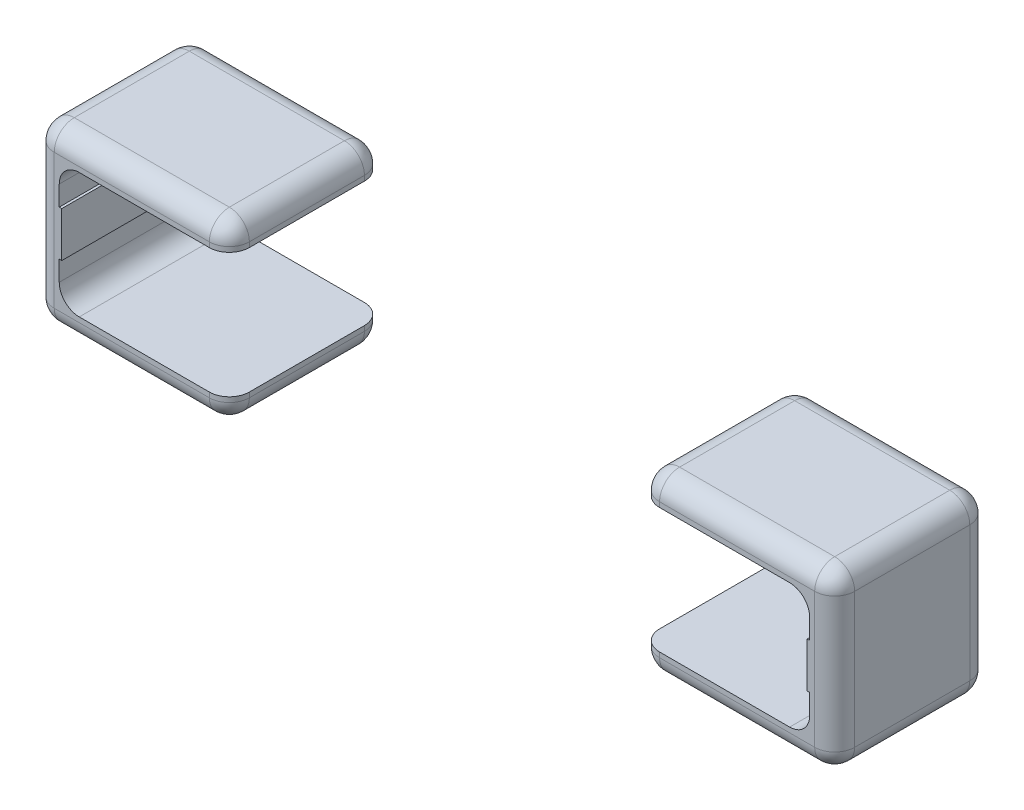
ISO-10303-21;
HEADER;
FILE_DESCRIPTION(('STEP AP214'),'2;1');
FILE_NAME('part.step','',(''),(''),'','','');
FILE_SCHEMA(('AUTOMOTIVE_DESIGN { 1 0 10303 214 1 1 1 1 }'));
ENDSEC;
DATA;
#1=APPLICATION_CONTEXT('core data for automotive mechanical design processes');
#2=APPLICATION_PROTOCOL_DEFINITION('international standard','automotive_design',2000,#1);
#3=PRODUCT_CONTEXT('',#1,'mechanical');
#4=PRODUCT('Part','Part','',(#3));
#5=PRODUCT_RELATED_PRODUCT_CATEGORY('part','',(#4));
#6=PRODUCT_DEFINITION_FORMATION('','',#4);
#7=PRODUCT_DEFINITION_CONTEXT('part definition',#1,'design');
#8=PRODUCT_DEFINITION('design','',#6,#7);
#9=PRODUCT_DEFINITION_SHAPE('','',#8);
#10=(LENGTH_UNIT() NAMED_UNIT(*) SI_UNIT(.MILLI.,.METRE.));
#11=(NAMED_UNIT(*) PLANE_ANGLE_UNIT() SI_UNIT($,.RADIAN.));
#12=(NAMED_UNIT(*) SI_UNIT($,.STERADIAN.) SOLID_ANGLE_UNIT());
#13=UNCERTAINTY_MEASURE_WITH_UNIT(LENGTH_MEASURE(1.E-05),#10,'distance_accuracy_value','');
#14=(GEOMETRIC_REPRESENTATION_CONTEXT(3) GLOBAL_UNCERTAINTY_ASSIGNED_CONTEXT((#13)) GLOBAL_UNIT_ASSIGNED_CONTEXT((#10,
#11,#12)) REPRESENTATION_CONTEXT('',''));
#15=CARTESIAN_POINT('',(0.,0.,0.));
#16=DIRECTION('',(0.,0.,1.));
#17=DIRECTION('',(1.,0.,0.));
#18=AXIS2_PLACEMENT_3D('',#15,#16,#17);
#19=CARTESIAN_POINT('',(-40.,12.5,1.5));
#20=DIRECTION('',(0.,-1.,0.));
#21=DIRECTION('',(0.,0.,-1.));
#22=AXIS2_PLACEMENT_3D('',#19,#20,#21);
#23=PLANE('',#22);
#24=DIRECTION('',(-1.,0.,0.));
#25=VECTOR('',#24,1.);
#26=CARTESIAN_POINT('',(-40.,12.5,-13.));
#27=LINE('',#26,#25);
#28=CARTESIAN_POINT('',(38.,12.5,-13.));
#29=VERTEX_POINT('',#28);
#30=CARTESIAN_POINT('',(22.5,12.5,-13.));
#31=VERTEX_POINT('',#30);
#32=EDGE_CURVE('E350',#29,#31,#27,.T.);
#33=ORIENTED_EDGE('',*,*,#32,.T.);
#34=DIRECTION('',(0.,0.,1.));
#35=VECTOR('',#34,1.);
#36=CARTESIAN_POINT('',(22.5,12.5,1.5));
#37=LINE('',#36,#35);
#38=CARTESIAN_POINT('',(22.5,12.5,-1.5));
#39=VERTEX_POINT('',#38);
#40=EDGE_CURVE('E12',#31,#39,#37,.T.);
#41=ORIENTED_EDGE('',*,*,#40,.T.);
#42=DIRECTION('',(-1.,0.,0.));
#43=VECTOR('',#42,1.);
#44=CARTESIAN_POINT('',(40.,12.5,-1.5));
#45=LINE('',#44,#43);
#46=CARTESIAN_POINT('',(38.,12.5,-1.5));
#47=VERTEX_POINT('',#46);
#48=EDGE_CURVE('E275',#39,#47,#45,.F.);
#49=ORIENTED_EDGE('',*,*,#48,.T.);
#50=DIRECTION('',(0.,0.,-1.));
#51=VECTOR('',#50,1.);
#52=CARTESIAN_POINT('',(38.,12.5,1.5));
#53=LINE('',#52,#51);
#54=EDGE_CURVE('E272',#47,#29,#53,.T.);
#55=ORIENTED_EDGE('',*,*,#54,.T.);
#56=EDGE_LOOP('',(#33,#41,#49,#55));
#57=FACE_BOUND('',#56,.T.);
#58=ADVANCED_FACE('F42',(#57),#23,.F.);
#59=CARTESIAN_POINT('',(-40.,-5.00000000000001,1.5));
#60=DIRECTION('',(0.,1.,0.));
#61=DIRECTION('',(-1.,0.,0.));
#62=AXIS2_PLACEMENT_3D('',#59,#60,#61);
#63=PLANE('',#62);
#64=DIRECTION('',(1.,0.,0.));
#65=VECTOR('',#64,1.);
#66=CARTESIAN_POINT('',(-40.,-5.00000000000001,-1.5));
#67=LINE('',#66,#65);
#68=CARTESIAN_POINT('',(38.,-5.,-1.5));
#69=VERTEX_POINT('',#68);
#70=CARTESIAN_POINT('',(22.5,-5.,-1.5));
#71=VERTEX_POINT('',#70);
#72=EDGE_CURVE('E274',#69,#71,#67,.F.);
#73=ORIENTED_EDGE('',*,*,#72,.T.);
#74=DIRECTION('',(0.,0.,-1.));
#75=VECTOR('',#74,1.);
#76=CARTESIAN_POINT('',(22.5,-5.,1.5));
#77=LINE('',#76,#75);
#78=CARTESIAN_POINT('',(22.5,-5.,-13.));
#79=VERTEX_POINT('',#78);
#80=EDGE_CURVE('E51',#71,#79,#77,.T.);
#81=ORIENTED_EDGE('',*,*,#80,.T.);
#82=DIRECTION('',(1.,0.,0.));
#83=VECTOR('',#82,1.);
#84=CARTESIAN_POINT('',(-40.,-5.00000000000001,-13.));
#85=LINE('',#84,#83);
#86=CARTESIAN_POINT('',(38.,-5.,-13.));
#87=VERTEX_POINT('',#86);
#88=EDGE_CURVE('E277',#79,#87,#85,.T.);
#89=ORIENTED_EDGE('',*,*,#88,.T.);
#90=DIRECTION('',(0.,0.,-1.));
#91=VECTOR('',#90,1.);
#92=CARTESIAN_POINT('',(38.,-5.,1.5));
#93=LINE('',#92,#91);
#94=EDGE_CURVE('E226',#87,#69,#93,.F.);
#95=ORIENTED_EDGE('',*,*,#94,.T.);
#96=EDGE_LOOP('',(#73,#81,#89,#95));
#97=FACE_BOUND('',#96,.T.);
#98=ADVANCED_FACE('F494',(#97),#63,.F.);
#99=CARTESIAN_POINT('',(40.,12.5,-15.));
#100=DIRECTION('',(0.,0.,1.));
#101=DIRECTION('',(1.,0.,0.));
#102=AXIS2_PLACEMENT_3D('',#99,#100,#101);
#103=PLANE('',#102);
#104=DIRECTION('',(1.,0.,0.));
#105=VECTOR('',#104,1.);
#106=CARTESIAN_POINT('',(40.,-3.,-15.));
#107=LINE('',#106,#105);
#108=CARTESIAN_POINT('',(38.,-3.,-15.));
#109=VERTEX_POINT('',#108);
#110=CARTESIAN_POINT('',(22.5,-3.,-15.));
#111=VERTEX_POINT('',#110);
#112=EDGE_CURVE('E208',#109,#111,#107,.F.);
#113=ORIENTED_EDGE('',*,*,#112,.T.);
#114=DIRECTION('',(0.,-1.,0.));
#115=VECTOR('',#114,1.);
#116=CARTESIAN_POINT('',(22.5,12.5,-15.));
#117=LINE('',#116,#115);
#118=CARTESIAN_POINT('',(22.5,-2.5,-15.));
#119=VERTEX_POINT('',#118);
#120=EDGE_CURVE('E383',#111,#119,#117,.F.);
#121=ORIENTED_EDGE('',*,*,#120,.T.);
#122=DIRECTION('',(-1.,0.,0.));
#123=VECTOR('',#122,1.);
#124=CARTESIAN_POINT('',(35.5,-2.5,-15.));
#125=LINE('',#124,#123);
#126=CARTESIAN_POINT('',(35.5,-2.5,-15.));
#127=VERTEX_POINT('',#126);
#128=EDGE_CURVE('E320',#127,#119,#125,.T.);
#129=ORIENTED_EDGE('',*,*,#128,.F.);
#130=CARTESIAN_POINT('',(35.5,-0.5,-15.));
#131=DIRECTION('',(0.,0.,1.));
#132=DIRECTION('',(1.,0.,0.));
#133=AXIS2_PLACEMENT_3D('',#130,#131,#132);
#134=CIRCLE('',#133,2.);
#135=CARTESIAN_POINT('',(37.5,-0.5,-15.));
#136=VERTEX_POINT('',#135);
#137=EDGE_CURVE('E294',#136,#127,#134,.F.);
#138=ORIENTED_EDGE('',*,*,#137,.F.);
#139=DIRECTION('',(0.,-1.,0.));
#140=VECTOR('',#139,1.);
#141=CARTESIAN_POINT('',(37.5,1.5,-15.));
#142=LINE('',#141,#140);
#143=CARTESIAN_POINT('',(37.5,1.5,-15.));
#144=VERTEX_POINT('',#143);
#145=EDGE_CURVE('E298',#144,#136,#142,.T.);
#146=ORIENTED_EDGE('',*,*,#145,.F.);
#147=DIRECTION('',(1.,0.,0.));
#148=VECTOR('',#147,1.);
#149=CARTESIAN_POINT('',(37.5,1.5,-15.));
#150=LINE('',#149,#148);
#151=CARTESIAN_POINT('',(37.25,1.5,-15.));
#152=VERTEX_POINT('',#151);
#153=EDGE_CURVE('E302',#152,#144,#150,.T.);
#154=ORIENTED_EDGE('',*,*,#153,.F.);
#155=DIRECTION('',(0.,-1.,0.));
#156=VECTOR('',#155,1.);
#157=CARTESIAN_POINT('',(37.25,6.,-15.));
#158=LINE('',#157,#156);
#159=CARTESIAN_POINT('',(37.25,6.,-15.));
#160=VERTEX_POINT('',#159);
#161=EDGE_CURVE('E306',#160,#152,#158,.T.);
#162=ORIENTED_EDGE('',*,*,#161,.F.);
#163=DIRECTION('',(-1.,0.,0.));
#164=VECTOR('',#163,1.);
#165=CARTESIAN_POINT('',(37.25,6.,-15.));
#166=LINE('',#165,#164);
#167=CARTESIAN_POINT('',(37.5,6.,-15.));
#168=VERTEX_POINT('',#167);
#169=EDGE_CURVE('E310',#168,#160,#166,.T.);
#170=ORIENTED_EDGE('',*,*,#169,.F.);
#171=DIRECTION('',(0.,-1.,0.));
#172=VECTOR('',#171,1.);
#173=CARTESIAN_POINT('',(37.5,8.,-15.));
#174=LINE('',#173,#172);
#175=CARTESIAN_POINT('',(37.5,8.,-15.));
#176=VERTEX_POINT('',#175);
#177=EDGE_CURVE('E314',#176,#168,#174,.T.);
#178=ORIENTED_EDGE('',*,*,#177,.F.);
#179=CARTESIAN_POINT('',(35.5,8.,-15.));
#180=DIRECTION('',(0.,0.,1.));
#181=DIRECTION('',(1.,0.,0.));
#182=AXIS2_PLACEMENT_3D('',#179,#180,#181);
#183=CIRCLE('',#182,2.);
#184=CARTESIAN_POINT('',(35.5,10.,-15.));
#185=VERTEX_POINT('',#184);
#186=EDGE_CURVE('E287',#185,#176,#183,.F.);
#187=ORIENTED_EDGE('',*,*,#186,.F.);
#188=DIRECTION('',(1.,0.,0.));
#189=VECTOR('',#188,1.);
#190=CARTESIAN_POINT('',(-35.5,10.,-15.));
#191=LINE('',#190,#189);
#192=CARTESIAN_POINT('',(22.5,10.,-15.));
#193=VERTEX_POINT('',#192);
#194=EDGE_CURVE('E321',#193,#185,#191,.T.);
#195=ORIENTED_EDGE('',*,*,#194,.F.);
#196=DIRECTION('',(0.,-1.,0.));
#197=VECTOR('',#196,1.);
#198=CARTESIAN_POINT('',(22.5,12.5,-15.));
#199=LINE('',#198,#197);
#200=CARTESIAN_POINT('',(22.5,10.5,-15.));
#201=VERTEX_POINT('',#200);
#202=EDGE_CURVE('E381',#193,#201,#199,.F.);
#203=ORIENTED_EDGE('',*,*,#202,.T.);
#204=DIRECTION('',(-1.,0.,0.));
#205=VECTOR('',#204,1.);
#206=CARTESIAN_POINT('',(40.,10.5,-15.));
#207=LINE('',#206,#205);
#208=CARTESIAN_POINT('',(38.,10.5,-15.));
#209=VERTEX_POINT('',#208);
#210=EDGE_CURVE('E210',#201,#209,#207,.F.);
#211=ORIENTED_EDGE('',*,*,#210,.T.);
#212=DIRECTION('',(0.,1.,0.));
#213=VECTOR('',#212,1.);
#214=CARTESIAN_POINT('',(38.,12.5,-15.));
#215=LINE('',#214,#213);
#216=EDGE_CURVE('E205',#209,#109,#215,.F.);
#217=ORIENTED_EDGE('',*,*,#216,.T.);
#218=EDGE_LOOP('',(#113,#121,#129,#138,#146,#154,#162,#170,#178,#187,#195,#203,#211,#217));
#219=FACE_BOUND('',#218,.T.);
#220=ADVANCED_FACE('F207',(#219),#103,.F.);
#221=CARTESIAN_POINT('',(-50.,-15.,0.5));
#222=DIRECTION('',(0.,0.,1.));
#223=DIRECTION('',(1.,0.,0.));
#224=AXIS2_PLACEMENT_3D('',#221,#222,#223);
#225=PLANE('',#224);
#226=DIRECTION('',(1.,0.,0.));
#227=VECTOR('',#226,1.);
#228=CARTESIAN_POINT('',(35.5,-2.5,0.5));
#229=LINE('',#228,#227);
#230=CARTESIAN_POINT('',(22.5,-2.5,0.5));
#231=VERTEX_POINT('',#230);
#232=CARTESIAN_POINT('',(35.5,-2.5,0.5));
#233=VERTEX_POINT('',#232);
#234=EDGE_CURVE('E283',#231,#233,#229,.T.);
#235=ORIENTED_EDGE('',*,*,#234,.F.);
#236=DIRECTION('',(0.,-1.,0.));
#237=VECTOR('',#236,1.);
#238=CARTESIAN_POINT('',(22.5,-3.00000000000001,0.5));
#239=LINE('',#238,#237);
#240=CARTESIAN_POINT('',(22.5,-3.,0.5));
#241=VERTEX_POINT('',#240);
#242=EDGE_CURVE('E366',#231,#241,#239,.T.);
#243=ORIENTED_EDGE('',*,*,#242,.T.);
#244=DIRECTION('',(1.,0.,0.));
#245=VECTOR('',#244,1.);
#246=CARTESIAN_POINT('',(40.,-3.,0.5));
#247=LINE('',#246,#245);
#248=CARTESIAN_POINT('',(38.,-3.,0.5));
#249=VERTEX_POINT('',#248);
#250=EDGE_CURVE('E215',#241,#249,#247,.T.);
#251=ORIENTED_EDGE('',*,*,#250,.T.);
#252=DIRECTION('',(0.,1.,0.));
#253=VECTOR('',#252,1.);
#254=CARTESIAN_POINT('',(38.,12.5,0.5));
#255=LINE('',#254,#253);
#256=CARTESIAN_POINT('',(38.,10.5,0.5));
#257=VERTEX_POINT('',#256);
#258=EDGE_CURVE('E288',#249,#257,#255,.T.);
#259=ORIENTED_EDGE('',*,*,#258,.T.);
#260=DIRECTION('',(-1.,0.,0.));
#261=VECTOR('',#260,1.);
#262=CARTESIAN_POINT('',(-40.,10.5,0.5));
#263=LINE('',#262,#261);
#264=CARTESIAN_POINT('',(22.5,10.5,0.5));
#265=VERTEX_POINT('',#264);
#266=EDGE_CURVE('E291',#257,#265,#263,.T.);
#267=ORIENTED_EDGE('',*,*,#266,.T.);
#268=DIRECTION('',(0.,-1.,0.));
#269=VECTOR('',#268,1.);
#270=CARTESIAN_POINT('',(22.5,10.,0.5));
#271=LINE('',#270,#269);
#272=CARTESIAN_POINT('',(22.5,10.,0.5));
#273=VERTEX_POINT('',#272);
#274=EDGE_CURVE('E270',#265,#273,#271,.T.);
#275=ORIENTED_EDGE('',*,*,#274,.T.);
#276=DIRECTION('',(-1.,0.,0.));
#277=VECTOR('',#276,1.);
#278=CARTESIAN_POINT('',(-35.5,10.,0.5));
#279=LINE('',#278,#277);
#280=CARTESIAN_POINT('',(35.5,10.,0.5));
#281=VERTEX_POINT('',#280);
#282=EDGE_CURVE('E344',#281,#273,#279,.T.);
#283=ORIENTED_EDGE('',*,*,#282,.F.);
#284=CARTESIAN_POINT('',(35.5,8.,0.5));
#285=DIRECTION('',(0.,0.,1.));
#286=DIRECTION('',(1.,0.,0.));
#287=AXIS2_PLACEMENT_3D('',#284,#285,#286);
#288=CIRCLE('',#287,2.);
#289=CARTESIAN_POINT('',(37.5,8.,0.5));
#290=VERTEX_POINT('',#289);
#291=EDGE_CURVE('E317',#290,#281,#288,.T.);
#292=ORIENTED_EDGE('',*,*,#291,.F.);
#293=DIRECTION('',(0.,1.,0.));
#294=VECTOR('',#293,1.);
#295=CARTESIAN_POINT('',(37.5,8.,0.5));
#296=LINE('',#295,#294);
#297=CARTESIAN_POINT('',(37.5,6.,0.5));
#298=VERTEX_POINT('',#297);
#299=EDGE_CURVE('E313',#298,#290,#296,.T.);
#300=ORIENTED_EDGE('',*,*,#299,.F.);
#301=DIRECTION('',(1.,0.,0.));
#302=VECTOR('',#301,1.);
#303=CARTESIAN_POINT('',(37.25,6.,0.5));
#304=LINE('',#303,#302);
#305=CARTESIAN_POINT('',(37.25,6.,0.5));
#306=VERTEX_POINT('',#305);
#307=EDGE_CURVE('E309',#306,#298,#304,.T.);
#308=ORIENTED_EDGE('',*,*,#307,.F.);
#309=DIRECTION('',(0.,1.,0.));
#310=VECTOR('',#309,1.);
#311=CARTESIAN_POINT('',(37.25,6.,0.5));
#312=LINE('',#311,#310);
#313=CARTESIAN_POINT('',(37.25,1.5,0.5));
#314=VERTEX_POINT('',#313);
#315=EDGE_CURVE('E305',#314,#306,#312,.T.);
#316=ORIENTED_EDGE('',*,*,#315,.F.);
#317=DIRECTION('',(-1.,0.,0.));
#318=VECTOR('',#317,1.);
#319=CARTESIAN_POINT('',(37.5,1.5,0.5));
#320=LINE('',#319,#318);
#321=CARTESIAN_POINT('',(37.5,1.5,0.5));
#322=VERTEX_POINT('',#321);
#323=EDGE_CURVE('E301',#322,#314,#320,.T.);
#324=ORIENTED_EDGE('',*,*,#323,.F.);
#325=DIRECTION('',(0.,1.,0.));
#326=VECTOR('',#325,1.);
#327=CARTESIAN_POINT('',(37.5,1.5,0.5));
#328=LINE('',#327,#326);
#329=CARTESIAN_POINT('',(37.5,-0.5,0.5));
#330=VERTEX_POINT('',#329);
#331=EDGE_CURVE('E297',#330,#322,#328,.T.);
#332=ORIENTED_EDGE('',*,*,#331,.F.);
#333=CARTESIAN_POINT('',(35.5,-0.5,0.5));
#334=DIRECTION('',(0.,0.,1.));
#335=DIRECTION('',(1.,0.,0.));
#336=AXIS2_PLACEMENT_3D('',#333,#334,#335);
#337=CIRCLE('',#336,2.);
#338=EDGE_CURVE('E240',#233,#330,#337,.T.);
#339=ORIENTED_EDGE('',*,*,#338,.F.);
#340=EDGE_LOOP('',(#235,#243,#251,#259,#267,#275,#283,#292,#300,#308,#316,#324,#332,#339));
#341=FACE_BOUND('',#340,.T.);
#342=ADVANCED_FACE('F433',(#341),#225,.T.);
#343=CARTESIAN_POINT('',(-35.5,10.,-91.0345316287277));
#344=DIRECTION('',(0.,1.,0.));
#345=DIRECTION('',(-1.,0.,0.));
#346=AXIS2_PLACEMENT_3D('',#343,#344,#345);
#347=PLANE('',#346);
#348=DIRECTION('',(0.,0.,-1.));
#349=VECTOR('',#348,1.);
#350=CARTESIAN_POINT('',(20.5,10.,-91.0345316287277));
#351=LINE('',#350,#349);
#352=CARTESIAN_POINT('',(20.5,10.,-1.5));
#353=VERTEX_POINT('',#352);
#354=CARTESIAN_POINT('',(20.5,10.,-13.));
#355=VERTEX_POINT('',#354);
#356=EDGE_CURVE('E341',#353,#355,#351,.T.);
#357=ORIENTED_EDGE('',*,*,#356,.T.);
#358=CARTESIAN_POINT('',(22.5,10.,-13.));
#359=DIRECTION('',(0.,1.,0.));
#360=DIRECTION('',(-1.,0.,0.));
#361=AXIS2_PLACEMENT_3D('',#358,#359,#360);
#362=CIRCLE('',#361,2.);
#363=EDGE_CURVE('E395',#355,#193,#362,.F.);
#364=ORIENTED_EDGE('',*,*,#363,.T.);
#365=ORIENTED_EDGE('',*,*,#194,.T.);
#366=DIRECTION('',(0.,0.,1.));
#367=VECTOR('',#366,1.);
#368=CARTESIAN_POINT('',(35.5,10.,-91.0345316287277));
#369=LINE('',#368,#367);
#370=EDGE_CURVE('E318',#185,#281,#369,.T.);
#371=ORIENTED_EDGE('',*,*,#370,.T.);
#372=ORIENTED_EDGE('',*,*,#282,.T.);
#373=CARTESIAN_POINT('',(22.5,10.,-1.5));
#374=DIRECTION('',(0.,1.,0.));
#375=DIRECTION('',(-1.,0.,0.));
#376=AXIS2_PLACEMENT_3D('',#373,#374,#375);
#377=CIRCLE('',#376,2.);
#378=EDGE_CURVE('E393',#273,#353,#377,.F.);
#379=ORIENTED_EDGE('',*,*,#378,.T.);
#380=EDGE_LOOP('',(#357,#364,#365,#371,#372,#379));
#381=FACE_BOUND('',#380,.T.);
#382=ADVANCED_FACE('F437',(#381),#347,.F.);
#383=CARTESIAN_POINT('',(35.5,-2.5,-91.0345316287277));
#384=DIRECTION('',(0.,-1.,0.));
#385=DIRECTION('',(1.,0.,0.));
#386=AXIS2_PLACEMENT_3D('',#383,#384,#385);
#387=PLANE('',#386);
#388=DIRECTION('',(0.,0.,1.));
#389=VECTOR('',#388,1.);
#390=CARTESIAN_POINT('',(20.5,-2.5,-91.0345316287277));
#391=LINE('',#390,#389);
#392=CARTESIAN_POINT('',(20.5,-2.5,-13.));
#393=VERTEX_POINT('',#392);
#394=CARTESIAN_POINT('',(20.5,-2.5,-1.5));
#395=VERTEX_POINT('',#394);
#396=EDGE_CURVE('E345',#393,#395,#391,.T.);
#397=ORIENTED_EDGE('',*,*,#396,.T.);
#398=CARTESIAN_POINT('',(22.5,-2.5,-1.5));
#399=DIRECTION('',(0.,-1.,0.));
#400=DIRECTION('',(1.,0.,0.));
#401=AXIS2_PLACEMENT_3D('',#398,#399,#400);
#402=CIRCLE('',#401,2.);
#403=EDGE_CURVE('E377',#395,#231,#402,.F.);
#404=ORIENTED_EDGE('',*,*,#403,.T.);
#405=ORIENTED_EDGE('',*,*,#234,.T.);
#406=DIRECTION('',(0.,0.,1.));
#407=VECTOR('',#406,1.);
#408=CARTESIAN_POINT('',(35.5,-2.5,-91.0345316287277));
#409=LINE('',#408,#407);
#410=EDGE_CURVE('E243',#127,#233,#409,.T.);
#411=ORIENTED_EDGE('',*,*,#410,.F.);
#412=ORIENTED_EDGE('',*,*,#128,.T.);
#413=CARTESIAN_POINT('',(22.5,-2.5,-13.));
#414=DIRECTION('',(0.,-1.,0.));
#415=DIRECTION('',(1.,0.,0.));
#416=AXIS2_PLACEMENT_3D('',#413,#414,#415);
#417=CIRCLE('',#416,2.);
#418=EDGE_CURVE('E375',#119,#393,#417,.F.);
#419=ORIENTED_EDGE('',*,*,#418,.T.);
#420=EDGE_LOOP('',(#397,#404,#405,#411,#412,#419));
#421=FACE_BOUND('',#420,.T.);
#422=ADVANCED_FACE('F507',(#421),#387,.F.);
#423=CARTESIAN_POINT('',(-40.,-3.00000000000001,-13.));
#424=DIRECTION('',(1.,0.,0.));
#425=DIRECTION('',(0.,1.,0.));
#426=AXIS2_PLACEMENT_3D('',#423,#424,#425);
#427=CYLINDRICAL_SURFACE('',#426,2.);
#428=ORIENTED_EDGE('',*,*,#88,.F.);
#429=CARTESIAN_POINT('',(22.5,-3.,-13.));
#430=DIRECTION('',(1.,0.,0.));
#431=DIRECTION('',(0.,1.,0.));
#432=AXIS2_PLACEMENT_3D('',#429,#430,#431);
#433=CIRCLE('',#432,2.);
#434=EDGE_CURVE('E225',#79,#111,#433,.T.);
#435=ORIENTED_EDGE('',*,*,#434,.T.);
#436=ORIENTED_EDGE('',*,*,#112,.F.);
#437=CARTESIAN_POINT('',(38.,-3.,-13.));
#438=DIRECTION('',(1.,0.,0.));
#439=DIRECTION('',(0.,0.,-1.));
#440=AXIS2_PLACEMENT_3D('',#437,#438,#439);
#441=CIRCLE('',#440,2.);
#442=EDGE_CURVE('E222',#87,#109,#441,.T.);
#443=ORIENTED_EDGE('',*,*,#442,.F.);
#444=EDGE_LOOP('',(#428,#435,#436,#443));
#445=FACE_BOUND('',#444,.T.);
#446=ADVANCED_FACE('F220',(#445),#427,.T.);
#447=CARTESIAN_POINT('',(-40.,10.5,-13.));
#448=DIRECTION('',(-1.,0.,0.));
#449=DIRECTION('',(0.,0.,1.));
#450=AXIS2_PLACEMENT_3D('',#447,#448,#449);
#451=CYLINDRICAL_SURFACE('',#450,2.);
#452=ORIENTED_EDGE('',*,*,#210,.F.);
#453=CARTESIAN_POINT('',(22.5,10.5,-13.));
#454=DIRECTION('',(-1.,0.,0.));
#455=DIRECTION('',(0.,0.,1.));
#456=AXIS2_PLACEMENT_3D('',#453,#454,#455);
#457=CIRCLE('',#456,2.);
#458=EDGE_CURVE('E65',#201,#31,#457,.F.);
#459=ORIENTED_EDGE('',*,*,#458,.T.);
#460=ORIENTED_EDGE('',*,*,#32,.F.);
#461=CARTESIAN_POINT('',(38.,10.5,-13.));
#462=DIRECTION('',(1.,0.,0.));
#463=DIRECTION('',(0.,0.,-1.));
#464=AXIS2_PLACEMENT_3D('',#461,#462,#463);
#465=CIRCLE('',#464,2.);
#466=EDGE_CURVE('E246',#209,#29,#465,.T.);
#467=ORIENTED_EDGE('',*,*,#466,.F.);
#468=EDGE_LOOP('',(#452,#459,#460,#467));
#469=FACE_BOUND('',#468,.T.);
#470=ADVANCED_FACE('F609',(#469),#451,.T.);
#471=CARTESIAN_POINT('',(-50.,-3.00000000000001,-1.5));
#472=DIRECTION('',(-1.,0.,0.));
#473=DIRECTION('',(0.,-1.,0.));
#474=AXIS2_PLACEMENT_3D('',#471,#472,#473);
#475=CYLINDRICAL_SURFACE('',#474,2.);
#476=ORIENTED_EDGE('',*,*,#250,.F.);
#477=CARTESIAN_POINT('',(22.5,-3.,-1.5));
#478=DIRECTION('',(-1.,0.,0.));
#479=DIRECTION('',(0.,-1.,0.));
#480=AXIS2_PLACEMENT_3D('',#477,#478,#479);
#481=CIRCLE('',#480,2.);
#482=EDGE_CURVE('E379',#241,#71,#481,.F.);
#483=ORIENTED_EDGE('',*,*,#482,.T.);
#484=ORIENTED_EDGE('',*,*,#72,.F.);
#485=CARTESIAN_POINT('',(38.,-3.,-1.5));
#486=DIRECTION('',(1.,0.,0.));
#487=DIRECTION('',(0.,0.,-1.));
#488=AXIS2_PLACEMENT_3D('',#485,#486,#487);
#489=CIRCLE('',#488,2.);
#490=EDGE_CURVE('E255',#249,#69,#489,.T.);
#491=ORIENTED_EDGE('',*,*,#490,.F.);
#492=EDGE_LOOP('',(#476,#483,#484,#491));
#493=FACE_BOUND('',#492,.T.);
#494=ADVANCED_FACE('F489',(#493),#475,.T.);
#495=CARTESIAN_POINT('',(-50.,10.5,-1.5));
#496=DIRECTION('',(1.,0.,0.));
#497=DIRECTION('',(0.,0.,-1.));
#498=AXIS2_PLACEMENT_3D('',#495,#496,#497);
#499=CYLINDRICAL_SURFACE('',#498,2.);
#500=ORIENTED_EDGE('',*,*,#48,.F.);
#501=CARTESIAN_POINT('',(22.5,10.5,-1.5));
#502=DIRECTION('',(1.,0.,0.));
#503=DIRECTION('',(0.,0.,-1.));
#504=AXIS2_PLACEMENT_3D('',#501,#502,#503);
#505=CIRCLE('',#504,2.);
#506=EDGE_CURVE('E398',#39,#265,#505,.T.);
#507=ORIENTED_EDGE('',*,*,#506,.T.);
#508=ORIENTED_EDGE('',*,*,#266,.F.);
#509=CARTESIAN_POINT('',(38.,10.5,-1.5));
#510=DIRECTION('',(1.,0.,0.));
#511=DIRECTION('',(0.,0.,-1.));
#512=AXIS2_PLACEMENT_3D('',#509,#510,#511);
#513=CIRCLE('',#512,2.);
#514=EDGE_CURVE('E262',#47,#257,#513,.T.);
#515=ORIENTED_EDGE('',*,*,#514,.F.);
#516=EDGE_LOOP('',(#500,#507,#508,#515));
#517=FACE_BOUND('',#516,.T.);
#518=ADVANCED_FACE('F592',(#517),#499,.T.);
#519=CARTESIAN_POINT('',(40.,-5.,1.5));
#520=DIRECTION('',(-1.,0.,0.));
#521=DIRECTION('',(0.,0.,1.));
#522=AXIS2_PLACEMENT_3D('',#519,#520,#521);
#523=PLANE('',#522);
#524=DIRECTION('',(0.,1.,0.));
#525=VECTOR('',#524,1.);
#526=CARTESIAN_POINT('',(40.,-5.,-1.5));
#527=LINE('',#526,#525);
#528=CARTESIAN_POINT('',(40.,10.5,-1.5));
#529=VERTEX_POINT('',#528);
#530=CARTESIAN_POINT('',(40.,-3.,-1.5));
#531=VERTEX_POINT('',#530);
#532=EDGE_CURVE('E280',#529,#531,#527,.F.);
#533=ORIENTED_EDGE('',*,*,#532,.T.);
#534=DIRECTION('',(0.,0.,-1.));
#535=VECTOR('',#534,1.);
#536=CARTESIAN_POINT('',(40.,-3.,1.5));
#537=LINE('',#536,#535);
#538=CARTESIAN_POINT('',(40.,-3.,-13.));
#539=VERTEX_POINT('',#538);
#540=EDGE_CURVE('E278',#531,#539,#537,.T.);
#541=ORIENTED_EDGE('',*,*,#540,.T.);
#542=DIRECTION('',(0.,1.,0.));
#543=VECTOR('',#542,1.);
#544=CARTESIAN_POINT('',(40.,-5.,-13.));
#545=LINE('',#544,#543);
#546=CARTESIAN_POINT('',(40.,10.5,-13.));
#547=VERTEX_POINT('',#546);
#548=EDGE_CURVE('E232',#539,#547,#545,.T.);
#549=ORIENTED_EDGE('',*,*,#548,.T.);
#550=DIRECTION('',(0.,0.,-1.));
#551=VECTOR('',#550,1.);
#552=CARTESIAN_POINT('',(40.,10.5,1.5));
#553=LINE('',#552,#551);
#554=EDGE_CURVE('E285',#547,#529,#553,.F.);
#555=ORIENTED_EDGE('',*,*,#554,.T.);
#556=EDGE_LOOP('',(#533,#541,#549,#555));
#557=FACE_BOUND('',#556,.T.);
#558=ADVANCED_FACE('F597',(#557),#523,.F.);
#559=CARTESIAN_POINT('',(35.5,8.,-91.0345316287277));
#560=DIRECTION('',(0.,0.,1.));
#561=DIRECTION('',(1.,0.,0.));
#562=AXIS2_PLACEMENT_3D('',#559,#560,#561);
#563=CYLINDRICAL_SURFACE('',#562,2.);
#564=ORIENTED_EDGE('',*,*,#186,.T.);
#565=DIRECTION('',(0.,0.,1.));
#566=VECTOR('',#565,1.);
#567=CARTESIAN_POINT('',(37.5,8.,-91.0345316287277));
#568=LINE('',#567,#566);
#569=EDGE_CURVE('E315',#176,#290,#568,.T.);
#570=ORIENTED_EDGE('',*,*,#569,.T.);
#571=ORIENTED_EDGE('',*,*,#291,.T.);
#572=ORIENTED_EDGE('',*,*,#370,.F.);
#573=EDGE_LOOP('',(#564,#570,#571,#572));
#574=FACE_BOUND('',#573,.T.);
#575=ADVANCED_FACE('F443',(#574),#563,.F.);
#576=CARTESIAN_POINT('',(37.5,8.,-91.0345316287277));
#577=DIRECTION('',(1.,0.,0.));
#578=DIRECTION('',(0.,0.,-1.));
#579=AXIS2_PLACEMENT_3D('',#576,#577,#578);
#580=PLANE('',#579);
#581=ORIENTED_EDGE('',*,*,#177,.T.);
#582=DIRECTION('',(0.,0.,1.));
#583=VECTOR('',#582,1.);
#584=CARTESIAN_POINT('',(37.5,6.,-91.0345316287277));
#585=LINE('',#584,#583);
#586=EDGE_CURVE('E311',#168,#298,#585,.T.);
#587=ORIENTED_EDGE('',*,*,#586,.T.);
#588=ORIENTED_EDGE('',*,*,#299,.T.);
#589=ORIENTED_EDGE('',*,*,#569,.F.);
#590=EDGE_LOOP('',(#581,#587,#588,#589));
#591=FACE_BOUND('',#590,.T.);
#592=ADVANCED_FACE('F449',(#591),#580,.F.);
#593=CARTESIAN_POINT('',(37.25,6.,-91.0345316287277));
#594=DIRECTION('',(0.,-1.,0.));
#595=DIRECTION('',(0.,0.,-1.));
#596=AXIS2_PLACEMENT_3D('',#593,#594,#595);
#597=PLANE('',#596);
#598=ORIENTED_EDGE('',*,*,#169,.T.);
#599=DIRECTION('',(0.,0.,1.));
#600=VECTOR('',#599,1.);
#601=CARTESIAN_POINT('',(37.25,6.,-91.0345316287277));
#602=LINE('',#601,#600);
#603=EDGE_CURVE('E307',#160,#306,#602,.T.);
#604=ORIENTED_EDGE('',*,*,#603,.T.);
#605=ORIENTED_EDGE('',*,*,#307,.T.);
#606=ORIENTED_EDGE('',*,*,#586,.F.);
#607=EDGE_LOOP('',(#598,#604,#605,#606));
#608=FACE_BOUND('',#607,.T.);
#609=ADVANCED_FACE('F454',(#608),#597,.F.);
#610=CARTESIAN_POINT('',(37.25,6.,-91.0345316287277));
#611=DIRECTION('',(1.,0.,0.));
#612=DIRECTION('',(0.,0.,-1.));
#613=AXIS2_PLACEMENT_3D('',#610,#611,#612);
#614=PLANE('',#613);
#615=ORIENTED_EDGE('',*,*,#161,.T.);
#616=DIRECTION('',(0.,0.,1.));
#617=VECTOR('',#616,1.);
#618=CARTESIAN_POINT('',(37.25,1.5,-91.0345316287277));
#619=LINE('',#618,#617);
#620=EDGE_CURVE('E303',#152,#314,#619,.T.);
#621=ORIENTED_EDGE('',*,*,#620,.T.);
#622=ORIENTED_EDGE('',*,*,#315,.T.);
#623=ORIENTED_EDGE('',*,*,#603,.F.);
#624=EDGE_LOOP('',(#615,#621,#622,#623));
#625=FACE_BOUND('',#624,.T.);
#626=ADVANCED_FACE('F458',(#625),#614,.F.);
#627=CARTESIAN_POINT('',(37.5,1.5,-91.0345316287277));
#628=DIRECTION('',(0.,1.,0.));
#629=DIRECTION('',(0.,0.,1.));
#630=AXIS2_PLACEMENT_3D('',#627,#628,#629);
#631=PLANE('',#630);
#632=ORIENTED_EDGE('',*,*,#153,.T.);
#633=DIRECTION('',(0.,0.,1.));
#634=VECTOR('',#633,1.);
#635=CARTESIAN_POINT('',(37.5,1.5,-91.0345316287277));
#636=LINE('',#635,#634);
#637=EDGE_CURVE('E299',#144,#322,#636,.T.);
#638=ORIENTED_EDGE('',*,*,#637,.T.);
#639=ORIENTED_EDGE('',*,*,#323,.T.);
#640=ORIENTED_EDGE('',*,*,#620,.F.);
#641=EDGE_LOOP('',(#632,#638,#639,#640));
#642=FACE_BOUND('',#641,.T.);
#643=ADVANCED_FACE('F464',(#642),#631,.F.);
#644=CARTESIAN_POINT('',(37.5,1.5,-91.0345316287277));
#645=DIRECTION('',(1.,0.,0.));
#646=DIRECTION('',(0.,0.,-1.));
#647=AXIS2_PLACEMENT_3D('',#644,#645,#646);
#648=PLANE('',#647);
#649=ORIENTED_EDGE('',*,*,#145,.T.);
#650=DIRECTION('',(0.,0.,1.));
#651=VECTOR('',#650,1.);
#652=CARTESIAN_POINT('',(37.5,-0.5,-91.0345316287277));
#653=LINE('',#652,#651);
#654=EDGE_CURVE('E295',#136,#330,#653,.T.);
#655=ORIENTED_EDGE('',*,*,#654,.T.);
#656=ORIENTED_EDGE('',*,*,#331,.T.);
#657=ORIENTED_EDGE('',*,*,#637,.F.);
#658=EDGE_LOOP('',(#649,#655,#656,#657));
#659=FACE_BOUND('',#658,.T.);
#660=ADVANCED_FACE('F469',(#659),#648,.F.);
#661=CARTESIAN_POINT('',(35.5,-0.5,-91.0345316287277));
#662=DIRECTION('',(0.,0.,1.));
#663=DIRECTION('',(1.,0.,0.));
#664=AXIS2_PLACEMENT_3D('',#661,#662,#663);
#665=CYLINDRICAL_SURFACE('',#664,2.);
#666=ORIENTED_EDGE('',*,*,#137,.T.);
#667=ORIENTED_EDGE('',*,*,#410,.T.);
#668=ORIENTED_EDGE('',*,*,#338,.T.);
#669=ORIENTED_EDGE('',*,*,#654,.F.);
#670=EDGE_LOOP('',(#666,#667,#668,#669));
#671=FACE_BOUND('',#670,.T.);
#672=ADVANCED_FACE('F473',(#671),#665,.F.);
#673=CARTESIAN_POINT('',(38.,-5.,-13.));
#674=DIRECTION('',(0.,1.,0.));
#675=DIRECTION('',(0.,0.,1.));
#676=AXIS2_PLACEMENT_3D('',#673,#674,#675);
#677=CYLINDRICAL_SURFACE('',#676,2.);
#678=CARTESIAN_POINT('',(38.,-3.,-13.));
#679=DIRECTION('',(0.,-1.,0.));
#680=DIRECTION('',(1.,0.,0.));
#681=AXIS2_PLACEMENT_3D('',#678,#679,#680);
#682=CIRCLE('',#681,2.);
#683=EDGE_CURVE('E230',#109,#539,#682,.T.);
#684=ORIENTED_EDGE('',*,*,#683,.F.);
#685=ORIENTED_EDGE('',*,*,#216,.F.);
#686=CARTESIAN_POINT('',(38.,10.5,-13.));
#687=DIRECTION('',(0.,1.,0.));
#688=DIRECTION('',(0.,0.,1.));
#689=AXIS2_PLACEMENT_3D('',#686,#687,#688);
#690=CIRCLE('',#689,2.);
#691=EDGE_CURVE('E235',#547,#209,#690,.T.);
#692=ORIENTED_EDGE('',*,*,#691,.F.);
#693=ORIENTED_EDGE('',*,*,#548,.F.);
#694=EDGE_LOOP('',(#684,#685,#692,#693));
#695=FACE_BOUND('',#694,.T.);
#696=ADVANCED_FACE('F231',(#695),#677,.T.);
#697=CARTESIAN_POINT('',(38.,-3.,-13.));
#698=DIRECTION('',(0.,0.,1.));
#699=DIRECTION('',(1.,0.,0.));
#700=AXIS2_PLACEMENT_3D('',#697,#698,#699);
#701=SPHERICAL_SURFACE('',#700,2.);
#702=ORIENTED_EDGE('',*,*,#442,.T.);
#703=ORIENTED_EDGE('',*,*,#683,.T.);
#704=CARTESIAN_POINT('',(38.,-3.,-13.));
#705=DIRECTION('',(0.,0.,-1.));
#706=DIRECTION('',(-1.,0.,0.));
#707=AXIS2_PLACEMENT_3D('',#704,#705,#706);
#708=CIRCLE('',#707,2.);
#709=EDGE_CURVE('E238',#87,#539,#708,.F.);
#710=ORIENTED_EDGE('',*,*,#709,.F.);
#711=EDGE_LOOP('',(#702,#703,#710));
#712=FACE_BOUND('',#711,.T.);
#713=ADVANCED_FACE('F237',(#712),#701,.T.);
#714=CARTESIAN_POINT('',(38.,10.5,-13.));
#715=DIRECTION('',(0.,0.,1.));
#716=DIRECTION('',(1.,0.,0.));
#717=AXIS2_PLACEMENT_3D('',#714,#715,#716);
#718=SPHERICAL_SURFACE('',#717,2.);
#719=ORIENTED_EDGE('',*,*,#691,.T.);
#720=ORIENTED_EDGE('',*,*,#466,.T.);
#721=CARTESIAN_POINT('',(38.,10.5,-13.));
#722=DIRECTION('',(0.,0.,-1.));
#723=DIRECTION('',(-1.,0.,0.));
#724=AXIS2_PLACEMENT_3D('',#721,#722,#723);
#725=CIRCLE('',#724,2.);
#726=EDGE_CURVE('E252',#547,#29,#725,.F.);
#727=ORIENTED_EDGE('',*,*,#726,.F.);
#728=EDGE_LOOP('',(#719,#720,#727));
#729=FACE_BOUND('',#728,.T.);
#730=ADVANCED_FACE('F712',(#729),#718,.T.);
#731=CARTESIAN_POINT('',(38.,-3.,1.5));
#732=DIRECTION('',(0.,0.,-1.));
#733=DIRECTION('',(-1.,0.,0.));
#734=AXIS2_PLACEMENT_3D('',#731,#732,#733);
#735=CYLINDRICAL_SURFACE('',#734,2.);
#736=ORIENTED_EDGE('',*,*,#709,.T.);
#737=ORIENTED_EDGE('',*,*,#540,.F.);
#738=CARTESIAN_POINT('',(38.,-3.,-1.5));
#739=DIRECTION('',(0.,0.,1.));
#740=DIRECTION('',(1.,0.,0.));
#741=AXIS2_PLACEMENT_3D('',#738,#739,#740);
#742=CIRCLE('',#741,2.);
#743=EDGE_CURVE('E256',#69,#531,#742,.T.);
#744=ORIENTED_EDGE('',*,*,#743,.F.);
#745=ORIENTED_EDGE('',*,*,#94,.F.);
#746=EDGE_LOOP('',(#736,#737,#744,#745));
#747=FACE_BOUND('',#746,.T.);
#748=ADVANCED_FACE('F702',(#747),#735,.T.);
#749=CARTESIAN_POINT('',(38.,10.5,1.5));
#750=DIRECTION('',(0.,0.,-1.));
#751=DIRECTION('',(-1.,0.,0.));
#752=AXIS2_PLACEMENT_3D('',#749,#750,#751);
#753=CYLINDRICAL_SURFACE('',#752,2.);
#754=ORIENTED_EDGE('',*,*,#726,.T.);
#755=ORIENTED_EDGE('',*,*,#54,.F.);
#756=CARTESIAN_POINT('',(38.,10.5,-1.5));
#757=DIRECTION('',(0.,0.,1.));
#758=DIRECTION('',(1.,0.,0.));
#759=AXIS2_PLACEMENT_3D('',#756,#757,#758);
#760=CIRCLE('',#759,2.);
#761=EDGE_CURVE('E259',#529,#47,#760,.T.);
#762=ORIENTED_EDGE('',*,*,#761,.F.);
#763=ORIENTED_EDGE('',*,*,#554,.F.);
#764=EDGE_LOOP('',(#754,#755,#762,#763));
#765=FACE_BOUND('',#764,.T.);
#766=ADVANCED_FACE('F692',(#765),#753,.T.);
#767=CARTESIAN_POINT('',(38.,-3.,-1.5));
#768=DIRECTION('',(0.,0.,1.));
#769=DIRECTION('',(1.,0.,0.));
#770=AXIS2_PLACEMENT_3D('',#767,#768,#769);
#771=SPHERICAL_SURFACE('',#770,2.);
#772=ORIENTED_EDGE('',*,*,#490,.T.);
#773=ORIENTED_EDGE('',*,*,#743,.T.);
#774=CARTESIAN_POINT('',(38.,-3.,-1.5));
#775=DIRECTION('',(0.,-1.,0.));
#776=DIRECTION('',(0.,0.,-1.));
#777=AXIS2_PLACEMENT_3D('',#774,#775,#776);
#778=CIRCLE('',#777,2.);
#779=EDGE_CURVE('E265',#249,#531,#778,.F.);
#780=ORIENTED_EDGE('',*,*,#779,.F.);
#781=EDGE_LOOP('',(#772,#773,#780));
#782=FACE_BOUND('',#781,.T.);
#783=ADVANCED_FACE('F682',(#782),#771,.T.);
#784=CARTESIAN_POINT('',(38.,10.5,-1.5));
#785=DIRECTION('',(0.,0.,1.));
#786=DIRECTION('',(1.,0.,0.));
#787=AXIS2_PLACEMENT_3D('',#784,#785,#786);
#788=SPHERICAL_SURFACE('',#787,2.);
#789=ORIENTED_EDGE('',*,*,#761,.T.);
#790=ORIENTED_EDGE('',*,*,#514,.T.);
#791=CARTESIAN_POINT('',(38.,10.5,-1.5));
#792=DIRECTION('',(0.,1.,0.));
#793=DIRECTION('',(-1.,0.,0.));
#794=AXIS2_PLACEMENT_3D('',#791,#792,#793);
#795=CIRCLE('',#794,2.);
#796=EDGE_CURVE('E269',#529,#257,#795,.F.);
#797=ORIENTED_EDGE('',*,*,#796,.F.);
#798=EDGE_LOOP('',(#789,#790,#797));
#799=FACE_BOUND('',#798,.T.);
#800=ADVANCED_FACE('F672',(#799),#788,.T.);
#801=CARTESIAN_POINT('',(38.,-15.,-1.5));
#802=DIRECTION('',(0.,-1.,0.));
#803=DIRECTION('',(0.,0.,-1.));
#804=AXIS2_PLACEMENT_3D('',#801,#802,#803);
#805=CYLINDRICAL_SURFACE('',#804,2.);
#806=ORIENTED_EDGE('',*,*,#779,.T.);
#807=ORIENTED_EDGE('',*,*,#532,.F.);
#808=ORIENTED_EDGE('',*,*,#796,.T.);
#809=ORIENTED_EDGE('',*,*,#258,.F.);
#810=EDGE_LOOP('',(#806,#807,#808,#809));
#811=FACE_BOUND('',#810,.T.);
#812=ADVANCED_FACE('F519',(#811),#805,.T.);
#813=CARTESIAN_POINT('',(20.5,24.8500281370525,0.5));
#814=DIRECTION('',(1.,0.,0.));
#815=DIRECTION('',(0.,1.,0.));
#816=AXIS2_PLACEMENT_3D('',#813,#814,#815);
#817=PLANE('',#816);
#818=DIRECTION('',(0.,0.,1.));
#819=VECTOR('',#818,1.);
#820=CARTESIAN_POINT('',(20.5,10.5,0.5));
#821=LINE('',#820,#819);
#822=CARTESIAN_POINT('',(20.5,10.5,-1.5));
#823=VERTEX_POINT('',#822);
#824=CARTESIAN_POINT('',(20.5,10.5,-13.));
#825=VERTEX_POINT('',#824);
#826=EDGE_CURVE('E386',#823,#825,#821,.F.);
#827=ORIENTED_EDGE('',*,*,#826,.T.);
#828=DIRECTION('',(0.,-1.,0.));
#829=VECTOR('',#828,1.);
#830=CARTESIAN_POINT('',(20.5,24.8500281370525,-13.));
#831=LINE('',#830,#829);
#832=EDGE_CURVE('E390',#825,#355,#831,.T.);
#833=ORIENTED_EDGE('',*,*,#832,.T.);
#834=ORIENTED_EDGE('',*,*,#356,.F.);
#835=DIRECTION('',(0.,-1.,0.));
#836=VECTOR('',#835,1.);
#837=CARTESIAN_POINT('',(20.5,10.5,-1.5));
#838=LINE('',#837,#836);
#839=EDGE_CURVE('E388',#353,#823,#838,.F.);
#840=ORIENTED_EDGE('',*,*,#839,.T.);
#841=EDGE_LOOP('',(#827,#833,#834,#840));
#842=FACE_BOUND('',#841,.T.);
#843=ADVANCED_FACE('F512',(#842),#817,.F.);
#844=DIRECTION('',(0.,0.,-1.));
#845=VECTOR('',#844,1.);
#846=CARTESIAN_POINT('',(20.5,-3.,0.5));
#847=LINE('',#846,#845);
#848=CARTESIAN_POINT('',(20.5,-3.,-13.));
#849=VERTEX_POINT('',#848);
#850=CARTESIAN_POINT('',(20.5,-3.,-1.5));
#851=VERTEX_POINT('',#850);
#852=EDGE_CURVE('E369',#849,#851,#847,.F.);
#853=ORIENTED_EDGE('',*,*,#852,.T.);
#854=DIRECTION('',(0.,-1.,0.));
#855=VECTOR('',#854,1.);
#856=CARTESIAN_POINT('',(20.5,-2.5,-1.5));
#857=LINE('',#856,#855);
#858=EDGE_CURVE('E373',#851,#395,#857,.F.);
#859=ORIENTED_EDGE('',*,*,#858,.T.);
#860=ORIENTED_EDGE('',*,*,#396,.F.);
#861=DIRECTION('',(0.,-1.,0.));
#862=VECTOR('',#861,1.);
#863=CARTESIAN_POINT('',(20.5,24.8500281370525,-13.));
#864=LINE('',#863,#862);
#865=EDGE_CURVE('E371',#393,#849,#864,.T.);
#866=ORIENTED_EDGE('',*,*,#865,.T.);
#867=EDGE_LOOP('',(#853,#859,#860,#866));
#868=FACE_BOUND('',#867,.T.);
#869=ADVANCED_FACE('F510',(#868),#817,.F.);
#870=CARTESIAN_POINT('',(22.5,24.8500281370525,-13.));
#871=DIRECTION('',(0.,-1.,0.));
#872=DIRECTION('',(1.,0.,0.));
#873=AXIS2_PLACEMENT_3D('',#870,#871,#872);
#874=CYLINDRICAL_SURFACE('',#873,2.);
#875=ORIENTED_EDGE('',*,*,#418,.F.);
#876=ORIENTED_EDGE('',*,*,#120,.F.);
#877=CARTESIAN_POINT('',(22.5,-3.,-13.));
#878=DIRECTION('',(0.,-1.,0.));
#879=DIRECTION('',(1.,0.,0.));
#880=AXIS2_PLACEMENT_3D('',#877,#878,#879);
#881=CIRCLE('',#880,2.);
#882=EDGE_CURVE('E352',#849,#111,#881,.T.);
#883=ORIENTED_EDGE('',*,*,#882,.F.);
#884=ORIENTED_EDGE('',*,*,#865,.F.);
#885=EDGE_LOOP('',(#875,#876,#883,#884));
#886=FACE_BOUND('',#885,.T.);
#887=ADVANCED_FACE('F505',(#886),#874,.T.);
#888=CARTESIAN_POINT('',(22.5,-3.,-13.));
#889=DIRECTION('',(0.,0.,1.));
#890=DIRECTION('',(1.,0.,0.));
#891=AXIS2_PLACEMENT_3D('',#888,#889,#890);
#892=SPHERICAL_SURFACE('',#891,2.);
#893=ORIENTED_EDGE('',*,*,#882,.T.);
#894=ORIENTED_EDGE('',*,*,#434,.F.);
#895=CARTESIAN_POINT('',(22.5,-3.,-13.));
#896=DIRECTION('',(0.,0.,1.));
#897=DIRECTION('',(1.,0.,0.));
#898=AXIS2_PLACEMENT_3D('',#895,#896,#897);
#899=CIRCLE('',#898,2.);
#900=EDGE_CURVE('E406',#849,#79,#899,.T.);
#901=ORIENTED_EDGE('',*,*,#900,.F.);
#902=EDGE_LOOP('',(#893,#894,#901));
#903=FACE_BOUND('',#902,.T.);
#904=ADVANCED_FACE('F500',(#903),#892,.T.);
#905=CARTESIAN_POINT('',(22.5,-3.,1.5));
#906=DIRECTION('',(0.,0.,-1.));
#907=DIRECTION('',(-1.,0.,0.));
#908=AXIS2_PLACEMENT_3D('',#905,#906,#907);
#909=CYLINDRICAL_SURFACE('',#908,2.);
#910=ORIENTED_EDGE('',*,*,#900,.T.);
#911=ORIENTED_EDGE('',*,*,#80,.F.);
#912=CARTESIAN_POINT('',(22.5,-3.,-1.5));
#913=DIRECTION('',(0.,0.,1.));
#914=DIRECTION('',(1.,0.,0.));
#915=AXIS2_PLACEMENT_3D('',#912,#913,#914);
#916=CIRCLE('',#915,2.);
#917=EDGE_CURVE('E403',#851,#71,#916,.T.);
#918=ORIENTED_EDGE('',*,*,#917,.F.);
#919=ORIENTED_EDGE('',*,*,#852,.F.);
#920=EDGE_LOOP('',(#910,#911,#918,#919));
#921=FACE_BOUND('',#920,.T.);
#922=ADVANCED_FACE('F496',(#921),#909,.T.);
#923=CARTESIAN_POINT('',(22.5,-3.,-1.5));
#924=DIRECTION('',(0.,0.,1.));
#925=DIRECTION('',(1.,0.,0.));
#926=AXIS2_PLACEMENT_3D('',#923,#924,#925);
#927=SPHERICAL_SURFACE('',#926,2.);
#928=ORIENTED_EDGE('',*,*,#917,.T.);
#929=ORIENTED_EDGE('',*,*,#482,.F.);
#930=CARTESIAN_POINT('',(22.5,-3.,-1.5));
#931=DIRECTION('',(0.,1.,0.));
#932=DIRECTION('',(-1.,0.,0.));
#933=AXIS2_PLACEMENT_3D('',#930,#931,#932);
#934=CIRCLE('',#933,2.);
#935=EDGE_CURVE('E401',#851,#241,#934,.T.);
#936=ORIENTED_EDGE('',*,*,#935,.F.);
#937=EDGE_LOOP('',(#928,#929,#936));
#938=FACE_BOUND('',#937,.T.);
#939=ADVANCED_FACE('F485',(#938),#927,.T.);
#940=CARTESIAN_POINT('',(22.5,-15.,-1.5));
#941=DIRECTION('',(0.,1.,0.));
#942=DIRECTION('',(-1.,0.,0.));
#943=AXIS2_PLACEMENT_3D('',#940,#941,#942);
#944=CYLINDRICAL_SURFACE('',#943,2.);
#945=ORIENTED_EDGE('',*,*,#403,.F.);
#946=ORIENTED_EDGE('',*,*,#858,.F.);
#947=ORIENTED_EDGE('',*,*,#935,.T.);
#948=ORIENTED_EDGE('',*,*,#242,.F.);
#949=EDGE_LOOP('',(#945,#946,#947,#948));
#950=FACE_BOUND('',#949,.T.);
#951=ADVANCED_FACE('F480',(#950),#944,.T.);
#952=CARTESIAN_POINT('',(22.5,-15.,-1.5));
#953=DIRECTION('',(0.,1.,0.));
#954=DIRECTION('',(-1.,0.,0.));
#955=AXIS2_PLACEMENT_3D('',#952,#953,#954);
#956=CYLINDRICAL_SURFACE('',#955,2.);
#957=ORIENTED_EDGE('',*,*,#378,.F.);
#958=ORIENTED_EDGE('',*,*,#274,.F.);
#959=CARTESIAN_POINT('',(22.5,10.5,-1.5));
#960=DIRECTION('',(0.,1.,0.));
#961=DIRECTION('',(0.,0.,1.));
#962=AXIS2_PLACEMENT_3D('',#959,#960,#961);
#963=CIRCLE('',#962,2.);
#964=EDGE_CURVE('E46',#823,#265,#963,.T.);
#965=ORIENTED_EDGE('',*,*,#964,.F.);
#966=ORIENTED_EDGE('',*,*,#839,.F.);
#967=EDGE_LOOP('',(#957,#958,#965,#966));
#968=FACE_BOUND('',#967,.T.);
#969=ADVANCED_FACE('F44',(#968),#956,.T.);
#970=CARTESIAN_POINT('',(22.5,10.5,-1.5));
#971=DIRECTION('',(0.,0.,1.));
#972=DIRECTION('',(1.,0.,0.));
#973=AXIS2_PLACEMENT_3D('',#970,#971,#972);
#974=SPHERICAL_SURFACE('',#973,2.);
#975=ORIENTED_EDGE('',*,*,#964,.T.);
#976=ORIENTED_EDGE('',*,*,#506,.F.);
#977=CARTESIAN_POINT('',(22.5,10.5,-1.5));
#978=DIRECTION('',(0.,0.,-1.));
#979=DIRECTION('',(-1.,0.,0.));
#980=AXIS2_PLACEMENT_3D('',#977,#978,#979);
#981=CIRCLE('',#980,2.);
#982=EDGE_CURVE('E416',#823,#39,#981,.T.);
#983=ORIENTED_EDGE('',*,*,#982,.F.);
#984=EDGE_LOOP('',(#975,#976,#983));
#985=FACE_BOUND('',#984,.T.);
#986=ADVANCED_FACE('F425',(#985),#974,.T.);
#987=CARTESIAN_POINT('',(22.5,10.5,1.5));
#988=DIRECTION('',(0.,0.,1.));
#989=DIRECTION('',(1.,0.,0.));
#990=AXIS2_PLACEMENT_3D('',#987,#988,#989);
#991=CYLINDRICAL_SURFACE('',#990,2.);
#992=ORIENTED_EDGE('',*,*,#982,.T.);
#993=ORIENTED_EDGE('',*,*,#40,.F.);
#994=CARTESIAN_POINT('',(22.5,10.5,-13.));
#995=DIRECTION('',(0.,0.,-1.));
#996=DIRECTION('',(-1.,0.,0.));
#997=AXIS2_PLACEMENT_3D('',#994,#995,#996);
#998=CIRCLE('',#997,2.);
#999=EDGE_CURVE('E414',#825,#31,#998,.T.);
#1000=ORIENTED_EDGE('',*,*,#999,.F.);
#1001=ORIENTED_EDGE('',*,*,#826,.F.);
#1002=EDGE_LOOP('',(#992,#993,#1000,#1001));
#1003=FACE_BOUND('',#1002,.T.);
#1004=ADVANCED_FACE('F546',(#1003),#991,.T.);
#1005=CARTESIAN_POINT('',(22.5,10.5,-13.));
#1006=DIRECTION('',(0.,0.,1.));
#1007=DIRECTION('',(1.,0.,0.));
#1008=AXIS2_PLACEMENT_3D('',#1005,#1006,#1007);
#1009=SPHERICAL_SURFACE('',#1008,2.);
#1010=ORIENTED_EDGE('',*,*,#999,.T.);
#1011=ORIENTED_EDGE('',*,*,#458,.F.);
#1012=CARTESIAN_POINT('',(22.5,10.5,-13.));
#1013=DIRECTION('',(0.,-1.,0.));
#1014=DIRECTION('',(0.,0.,-1.));
#1015=AXIS2_PLACEMENT_3D('',#1012,#1013,#1014);
#1016=CIRCLE('',#1015,2.);
#1017=EDGE_CURVE('E411',#825,#201,#1016,.T.);
#1018=ORIENTED_EDGE('',*,*,#1017,.F.);
#1019=EDGE_LOOP('',(#1010,#1011,#1018));
#1020=FACE_BOUND('',#1019,.T.);
#1021=ADVANCED_FACE('F542',(#1020),#1009,.T.);
#1022=CARTESIAN_POINT('',(22.5,24.8500281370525,-13.));
#1023=DIRECTION('',(0.,-1.,0.));
#1024=DIRECTION('',(1.,0.,0.));
#1025=AXIS2_PLACEMENT_3D('',#1022,#1023,#1024);
#1026=CYLINDRICAL_SURFACE('',#1025,2.);
#1027=ORIENTED_EDGE('',*,*,#1017,.T.);
#1028=ORIENTED_EDGE('',*,*,#202,.F.);
#1029=ORIENTED_EDGE('',*,*,#363,.F.);
#1030=ORIENTED_EDGE('',*,*,#832,.F.);
#1031=EDGE_LOOP('',(#1027,#1028,#1029,#1030));
#1032=FACE_BOUND('',#1031,.T.);
#1033=ADVANCED_FACE('F539',(#1032),#1026,.T.);
#1034=CLOSED_SHELL('',(#58,#98,#220,#342,#382,#422,#446,#470,#494,#518,#558,#575,#592,#609,#626,
#643,#660,#672,#696,#713,#730,#748,#766,#783,#800,#812,#843,#869,#887,#904,#922,#939,#951,#969,
#986,#1004,#1021,#1033));
#1035=MANIFOLD_SOLID_BREP('B2',#1034);
#1036=CARTESIAN_POINT('',(-40.,12.5,1.5));
#1037=DIRECTION('',(1.,0.,0.));
#1038=DIRECTION('',(0.,0.,-1.));
#1039=AXIS2_PLACEMENT_3D('',#1036,#1037,#1038);
#1040=PLANE('',#1039);
#1041=DIRECTION('',(0.,-1.,0.));
#1042=VECTOR('',#1041,1.);
#1043=CARTESIAN_POINT('',(-40.,12.5,-13.));
#1044=LINE('',#1043,#1042);
#1045=CARTESIAN_POINT('',(-40.,10.5,-13.));
#1046=VERTEX_POINT('',#1045);
#1047=CARTESIAN_POINT('',(-40.,-3.00000000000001,-13.));
#1048=VERTEX_POINT('',#1047);
#1049=EDGE_CURVE('E1094',#1046,#1048,#1044,.T.);
#1050=ORIENTED_EDGE('',*,*,#1049,.T.);
#1051=DIRECTION('',(0.,0.,-1.));
#1052=VECTOR('',#1051,1.);
#1053=CARTESIAN_POINT('',(-40.,-3.00000000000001,1.5));
#1054=LINE('',#1053,#1052);
#1055=CARTESIAN_POINT('',(-40.,-3.00000000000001,-1.5));
#1056=VERTEX_POINT('',#1055);
#1057=EDGE_CURVE('E1099',#1048,#1056,#1054,.F.);
#1058=ORIENTED_EDGE('',*,*,#1057,.T.);
#1059=DIRECTION('',(0.,-1.,0.));
#1060=VECTOR('',#1059,1.);
#1061=CARTESIAN_POINT('',(-40.,12.5,-1.5));
#1062=LINE('',#1061,#1060);
#1063=CARTESIAN_POINT('',(-40.,10.5,-1.5));
#1064=VERTEX_POINT('',#1063);
#1065=EDGE_CURVE('E1096',#1056,#1064,#1062,.F.);
#1066=ORIENTED_EDGE('',*,*,#1065,.T.);
#1067=DIRECTION('',(0.,0.,-1.));
#1068=VECTOR('',#1067,1.);
#1069=CARTESIAN_POINT('',(-40.,10.5,1.5));
#1070=LINE('',#1069,#1068);
#1071=EDGE_CURVE('E1092',#1064,#1046,#1070,.T.);
#1072=ORIENTED_EDGE('',*,*,#1071,.T.);
#1073=EDGE_LOOP('',(#1050,#1058,#1066,#1072));
#1074=FACE_BOUND('',#1073,.T.);
#1075=ADVANCED_FACE('F860',(#1074),#1040,.F.);
#1076=CARTESIAN_POINT('',(-38.,10.5,1.5));
#1077=DIRECTION('',(0.,0.,-1.));
#1078=DIRECTION('',(-1.,0.,0.));
#1079=AXIS2_PLACEMENT_3D('',#1076,#1077,#1078);
#1080=CYLINDRICAL_SURFACE('',#1079,2.);
#1081=CARTESIAN_POINT('',(-38.,10.5,-13.));
#1082=DIRECTION('',(0.,0.,-1.));
#1083=DIRECTION('',(-1.,0.,0.));
#1084=AXIS2_PLACEMENT_3D('',#1081,#1082,#1083);
#1085=CIRCLE('',#1084,2.);
#1086=CARTESIAN_POINT('',(-38.,12.5,-13.));
#1087=VERTEX_POINT('',#1086);
#1088=EDGE_CURVE('E1143',#1087,#1046,#1085,.F.);
#1089=ORIENTED_EDGE('',*,*,#1088,.T.);
#1090=ORIENTED_EDGE('',*,*,#1071,.F.);
#1091=CARTESIAN_POINT('',(-38.,10.5,-1.5));
#1092=DIRECTION('',(0.,0.,1.));
#1093=DIRECTION('',(1.,0.,0.));
#1094=AXIS2_PLACEMENT_3D('',#1091,#1092,#1093);
#1095=CIRCLE('',#1094,2.);
#1096=CARTESIAN_POINT('',(-38.,12.5,-1.5));
#1097=VERTEX_POINT('',#1096);
#1098=EDGE_CURVE('E1129',#1097,#1064,#1095,.T.);
#1099=ORIENTED_EDGE('',*,*,#1098,.F.);
#1100=DIRECTION('',(0.,0.,-1.));
#1101=VECTOR('',#1100,1.);
#1102=CARTESIAN_POINT('',(-38.,12.5,1.5));
#1103=LINE('',#1102,#1101);
#1104=EDGE_CURVE('E1107',#1087,#1097,#1103,.F.);
#1105=ORIENTED_EDGE('',*,*,#1104,.F.);
#1106=EDGE_LOOP('',(#1089,#1090,#1099,#1105));
#1107=FACE_BOUND('',#1106,.T.);
#1108=ADVANCED_FACE('F1340',(#1107),#1080,.T.);
#1109=CARTESIAN_POINT('',(-38.,-3.00000000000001,1.5));
#1110=DIRECTION('',(0.,0.,-1.));
#1111=DIRECTION('',(-1.,0.,0.));
#1112=AXIS2_PLACEMENT_3D('',#1109,#1110,#1111);
#1113=CYLINDRICAL_SURFACE('',#1112,2.);
#1114=CARTESIAN_POINT('',(-38.,-3.00000000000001,-13.));
#1115=DIRECTION('',(0.,0.,-1.));
#1116=DIRECTION('',(-1.,0.,0.));
#1117=AXIS2_PLACEMENT_3D('',#1114,#1115,#1116);
#1118=CIRCLE('',#1117,2.);
#1119=CARTESIAN_POINT('',(-38.,-5.00000000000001,-13.));
#1120=VERTEX_POINT('',#1119);
#1121=EDGE_CURVE('E1146',#1048,#1120,#1118,.F.);
#1122=ORIENTED_EDGE('',*,*,#1121,.T.);
#1123=DIRECTION('',(0.,0.,-1.));
#1124=VECTOR('',#1123,1.);
#1125=CARTESIAN_POINT('',(-38.,-5.00000000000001,1.5));
#1126=LINE('',#1125,#1124);
#1127=CARTESIAN_POINT('',(-38.,-5.00000000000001,-1.5));
#1128=VERTEX_POINT('',#1127);
#1129=EDGE_CURVE('E1101',#1128,#1120,#1126,.T.);
#1130=ORIENTED_EDGE('',*,*,#1129,.F.);
#1131=CARTESIAN_POINT('',(-38.,-3.00000000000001,-1.5));
#1132=DIRECTION('',(0.,0.,1.));
#1133=DIRECTION('',(1.,0.,0.));
#1134=AXIS2_PLACEMENT_3D('',#1131,#1132,#1133);
#1135=CIRCLE('',#1134,2.);
#1136=EDGE_CURVE('E1137',#1056,#1128,#1135,.T.);
#1137=ORIENTED_EDGE('',*,*,#1136,.F.);
#1138=ORIENTED_EDGE('',*,*,#1057,.F.);
#1139=EDGE_LOOP('',(#1122,#1130,#1137,#1138));
#1140=FACE_BOUND('',#1139,.T.);
#1141=ADVANCED_FACE('F1346',(#1140),#1113,.T.);
#1142=CARTESIAN_POINT('',(-38.,12.5,-13.));
#1143=DIRECTION('',(0.,-1.,0.));
#1144=DIRECTION('',(0.,0.,-1.));
#1145=AXIS2_PLACEMENT_3D('',#1142,#1143,#1144);
#1146=CYLINDRICAL_SURFACE('',#1145,2.);
#1147=CARTESIAN_POINT('',(-38.,-3.00000000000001,-13.));
#1148=DIRECTION('',(0.,-1.,0.));
#1149=DIRECTION('',(0.,0.,-1.));
#1150=AXIS2_PLACEMENT_3D('',#1147,#1148,#1149);
#1151=CIRCLE('',#1150,2.);
#1152=CARTESIAN_POINT('',(-38.,-3.00000000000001,-15.));
#1153=VERTEX_POINT('',#1152);
#1154=EDGE_CURVE('E1155',#1048,#1153,#1151,.T.);
#1155=ORIENTED_EDGE('',*,*,#1154,.F.);
#1156=ORIENTED_EDGE('',*,*,#1049,.F.);
#1157=CARTESIAN_POINT('',(-38.,10.5,-13.));
#1158=DIRECTION('',(0.,1.,0.));
#1159=DIRECTION('',(0.,0.,1.));
#1160=AXIS2_PLACEMENT_3D('',#1157,#1158,#1159);
#1161=CIRCLE('',#1160,2.);
#1162=CARTESIAN_POINT('',(-38.,10.5,-15.));
#1163=VERTEX_POINT('',#1162);
#1164=EDGE_CURVE('E1152',#1163,#1046,#1161,.T.);
#1165=ORIENTED_EDGE('',*,*,#1164,.F.);
#1166=DIRECTION('',(0.,-1.,0.));
#1167=VECTOR('',#1166,1.);
#1168=CARTESIAN_POINT('',(-38.,12.5,-15.));
#1169=LINE('',#1168,#1167);
#1170=EDGE_CURVE('E1114',#1153,#1163,#1169,.F.);
#1171=ORIENTED_EDGE('',*,*,#1170,.F.);
#1172=EDGE_LOOP('',(#1155,#1156,#1165,#1171));
#1173=FACE_BOUND('',#1172,.T.);
#1174=ADVANCED_FACE('F1378',(#1173),#1146,.T.);
#1175=CARTESIAN_POINT('',(-37.5,6.00000000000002,-91.0345316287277));
#1176=DIRECTION('',(-1.,0.,0.));
#1177=DIRECTION('',(0.,0.,1.));
#1178=AXIS2_PLACEMENT_3D('',#1175,#1176,#1177);
#1179=PLANE('',#1178);
#1180=DIRECTION('',(0.,1.,0.));
#1181=VECTOR('',#1180,1.);
#1182=CARTESIAN_POINT('',(-37.5,6.00000000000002,-15.));
#1183=LINE('',#1182,#1181);
#1184=CARTESIAN_POINT('',(-37.5,6.00000000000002,-15.));
#1185=VERTEX_POINT('',#1184);
#1186=CARTESIAN_POINT('',(-37.5,8.,-15.));
#1187=VERTEX_POINT('',#1186);
#1188=EDGE_CURVE('E1082',#1185,#1187,#1183,.T.);
#1189=ORIENTED_EDGE('',*,*,#1188,.T.);
#1190=DIRECTION('',(0.,0.,1.));
#1191=VECTOR('',#1190,1.);
#1192=CARTESIAN_POINT('',(-37.5,8.,-91.0345316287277));
#1193=LINE('',#1192,#1191);
#1194=CARTESIAN_POINT('',(-37.5,8.,0.5));
#1195=VERTEX_POINT('',#1194);
#1196=EDGE_CURVE('E1035',#1187,#1195,#1193,.T.);
#1197=ORIENTED_EDGE('',*,*,#1196,.T.);
#1198=DIRECTION('',(0.,-1.,0.));
#1199=VECTOR('',#1198,1.);
#1200=CARTESIAN_POINT('',(-37.5,6.00000000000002,0.5));
#1201=LINE('',#1200,#1199);
#1202=CARTESIAN_POINT('',(-37.5,6.00000000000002,0.5));
#1203=VERTEX_POINT('',#1202);
#1204=EDGE_CURVE('E1039',#1195,#1203,#1201,.T.);
#1205=ORIENTED_EDGE('',*,*,#1204,.T.);
#1206=DIRECTION('',(0.,0.,1.));
#1207=VECTOR('',#1206,1.);
#1208=CARTESIAN_POINT('',(-37.5,6.00000000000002,-91.0345316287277));
#1209=LINE('',#1208,#1207);
#1210=EDGE_CURVE('E1023',#1185,#1203,#1209,.T.);
#1211=ORIENTED_EDGE('',*,*,#1210,.F.);
#1212=EDGE_LOOP('',(#1189,#1197,#1205,#1211));
#1213=FACE_BOUND('',#1212,.T.);
#1214=ADVANCED_FACE('F1040',(#1213),#1179,.F.);
#1215=CARTESIAN_POINT('',(-37.5,6.00000000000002,-91.0345316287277));
#1216=DIRECTION('',(0.,-1.,0.));
#1217=DIRECTION('',(0.,0.,-1.));
#1218=AXIS2_PLACEMENT_3D('',#1215,#1216,#1217);
#1219=PLANE('',#1218);
#1220=DIRECTION('',(-1.,0.,0.));
#1221=VECTOR('',#1220,1.);
#1222=CARTESIAN_POINT('',(-37.5,6.00000000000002,-15.));
#1223=LINE('',#1222,#1221);
#1224=CARTESIAN_POINT('',(-37.25,6.00000000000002,-15.));
#1225=VERTEX_POINT('',#1224);
#1226=EDGE_CURVE('E1031',#1225,#1185,#1223,.T.);
#1227=ORIENTED_EDGE('',*,*,#1226,.T.);
#1228=ORIENTED_EDGE('',*,*,#1210,.T.);
#1229=DIRECTION('',(1.,0.,0.));
#1230=VECTOR('',#1229,1.);
#1231=CARTESIAN_POINT('',(-37.5,6.00000000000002,0.5));
#1232=LINE('',#1231,#1230);
#1233=CARTESIAN_POINT('',(-37.25,6.00000000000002,0.5));
#1234=VERTEX_POINT('',#1233);
#1235=EDGE_CURVE('E1028',#1203,#1234,#1232,.T.);
#1236=ORIENTED_EDGE('',*,*,#1235,.T.);
#1237=DIRECTION('',(0.,0.,1.));
#1238=VECTOR('',#1237,1.);
#1239=CARTESIAN_POINT('',(-37.25,6.00000000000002,-91.0345316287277));
#1240=LINE('',#1239,#1238);
#1241=EDGE_CURVE('E1034',#1225,#1234,#1240,.T.);
#1242=ORIENTED_EDGE('',*,*,#1241,.F.);
#1243=EDGE_LOOP('',(#1227,#1228,#1236,#1242));
#1244=FACE_BOUND('',#1243,.T.);
#1245=ADVANCED_FACE('F1025',(#1244),#1219,.F.);
#1246=CARTESIAN_POINT('',(-37.25,1.5,-91.0345316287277));
#1247=DIRECTION('',(-1.,0.,0.));
#1248=DIRECTION('',(0.,-1.,0.));
#1249=AXIS2_PLACEMENT_3D('',#1246,#1247,#1248);
#1250=PLANE('',#1249);
#1251=DIRECTION('',(0.,1.,0.));
#1252=VECTOR('',#1251,1.);
#1253=CARTESIAN_POINT('',(-37.25,1.5,-15.));
#1254=LINE('',#1253,#1252);
#1255=CARTESIAN_POINT('',(-37.25,1.5,-15.));
#1256=VERTEX_POINT('',#1255);
#1257=EDGE_CURVE('E1254',#1256,#1225,#1254,.T.);
#1258=ORIENTED_EDGE('',*,*,#1257,.T.);
#1259=ORIENTED_EDGE('',*,*,#1241,.T.);
#1260=DIRECTION('',(0.,-1.,0.));
#1261=VECTOR('',#1260,1.);
#1262=CARTESIAN_POINT('',(-37.25,1.5,0.5));
#1263=LINE('',#1262,#1261);
#1264=CARTESIAN_POINT('',(-37.25,1.5,0.5));
#1265=VERTEX_POINT('',#1264);
#1266=EDGE_CURVE('E1050',#1234,#1265,#1263,.T.);
#1267=ORIENTED_EDGE('',*,*,#1266,.T.);
#1268=DIRECTION('',(0.,0.,1.));
#1269=VECTOR('',#1268,1.);
#1270=CARTESIAN_POINT('',(-37.25,1.5,-91.0345316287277));
#1271=LINE('',#1270,#1269);
#1272=EDGE_CURVE('E1078',#1256,#1265,#1271,.T.);
#1273=ORIENTED_EDGE('',*,*,#1272,.F.);
#1274=EDGE_LOOP('',(#1258,#1259,#1267,#1273));
#1275=FACE_BOUND('',#1274,.T.);
#1276=ADVANCED_FACE('F1253',(#1275),#1250,.F.);
#1277=CARTESIAN_POINT('',(-37.25,1.5,-91.0345316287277));
#1278=DIRECTION('',(0.,1.,0.));
#1279=DIRECTION('',(0.,0.,1.));
#1280=AXIS2_PLACEMENT_3D('',#1277,#1278,#1279);
#1281=PLANE('',#1280);
#1282=DIRECTION('',(1.,0.,0.));
#1283=VECTOR('',#1282,1.);
#1284=CARTESIAN_POINT('',(-37.25,1.5,-15.));
#1285=LINE('',#1284,#1283);
#1286=CARTESIAN_POINT('',(-37.5,1.5,-15.));
#1287=VERTEX_POINT('',#1286);
#1288=EDGE_CURVE('E1250',#1287,#1256,#1285,.T.);
#1289=ORIENTED_EDGE('',*,*,#1288,.T.);
#1290=ORIENTED_EDGE('',*,*,#1272,.T.);
#1291=DIRECTION('',(-1.,0.,0.));
#1292=VECTOR('',#1291,1.);
#1293=CARTESIAN_POINT('',(-37.25,1.5,0.5));
#1294=LINE('',#1293,#1292);
#1295=CARTESIAN_POINT('',(-37.5,1.5,0.5));
#1296=VERTEX_POINT('',#1295);
#1297=EDGE_CURVE('E1052',#1265,#1296,#1294,.T.);
#1298=ORIENTED_EDGE('',*,*,#1297,.T.);
#1299=DIRECTION('',(0.,0.,1.));
#1300=VECTOR('',#1299,1.);
#1301=CARTESIAN_POINT('',(-37.5,1.5,-91.0345316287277));
#1302=LINE('',#1301,#1300);
#1303=EDGE_CURVE('E1076',#1287,#1296,#1302,.T.);
#1304=ORIENTED_EDGE('',*,*,#1303,.F.);
#1305=EDGE_LOOP('',(#1289,#1290,#1298,#1304));
#1306=FACE_BOUND('',#1305,.T.);
#1307=ADVANCED_FACE('F1248',(#1306),#1281,.F.);
#1308=CARTESIAN_POINT('',(-37.5,-0.5,-91.0345316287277));
#1309=DIRECTION('',(-1.,0.,0.));
#1310=DIRECTION('',(0.,0.,1.));
#1311=AXIS2_PLACEMENT_3D('',#1308,#1309,#1310);
#1312=PLANE('',#1311);
#1313=DIRECTION('',(0.,1.,0.));
#1314=VECTOR('',#1313,1.);
#1315=CARTESIAN_POINT('',(-37.5,-0.5,-15.));
#1316=LINE('',#1315,#1314);
#1317=CARTESIAN_POINT('',(-37.5,-0.5,-15.));
#1318=VERTEX_POINT('',#1317);
#1319=EDGE_CURVE('E1245',#1318,#1287,#1316,.T.);
#1320=ORIENTED_EDGE('',*,*,#1319,.T.);
#1321=ORIENTED_EDGE('',*,*,#1303,.T.);
#1322=DIRECTION('',(0.,-1.,0.));
#1323=VECTOR('',#1322,1.);
#1324=CARTESIAN_POINT('',(-37.5,-0.5,0.5));
#1325=LINE('',#1324,#1323);
#1326=CARTESIAN_POINT('',(-37.5,-0.5,0.5));
#1327=VERTEX_POINT('',#1326);
#1328=EDGE_CURVE('E1058',#1296,#1327,#1325,.T.);
#1329=ORIENTED_EDGE('',*,*,#1328,.T.);
#1330=DIRECTION('',(0.,0.,1.));
#1331=VECTOR('',#1330,1.);
#1332=CARTESIAN_POINT('',(-37.5,-0.5,-91.0345316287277));
#1333=LINE('',#1332,#1331);
#1334=EDGE_CURVE('E1074',#1318,#1327,#1333,.T.);
#1335=ORIENTED_EDGE('',*,*,#1334,.F.);
#1336=EDGE_LOOP('',(#1320,#1321,#1329,#1335));
#1337=FACE_BOUND('',#1336,.T.);
#1338=ADVANCED_FACE('F1242',(#1337),#1312,.F.);
#1339=CARTESIAN_POINT('',(-38.,-15.,-1.5));
#1340=DIRECTION('',(0.,1.,0.));
#1341=DIRECTION('',(0.,0.,1.));
#1342=AXIS2_PLACEMENT_3D('',#1339,#1340,#1341);
#1343=CYLINDRICAL_SURFACE('',#1342,2.);
#1344=CARTESIAN_POINT('',(-38.,10.5,-1.5));
#1345=DIRECTION('',(0.,1.,0.));
#1346=DIRECTION('',(0.,0.,1.));
#1347=AXIS2_PLACEMENT_3D('',#1344,#1345,#1346);
#1348=CIRCLE('',#1347,2.);
#1349=CARTESIAN_POINT('',(-38.,10.5,0.5));
#1350=VERTEX_POINT('',#1349);
#1351=EDGE_CURVE('E1131',#1064,#1350,#1348,.T.);
#1352=ORIENTED_EDGE('',*,*,#1351,.F.);
#1353=ORIENTED_EDGE('',*,*,#1065,.F.);
#1354=CARTESIAN_POINT('',(-38.,-3.00000000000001,-1.5));
#1355=DIRECTION('',(0.,-1.,0.));
#1356=DIRECTION('',(1.,0.,0.));
#1357=AXIS2_PLACEMENT_3D('',#1354,#1355,#1356);
#1358=CIRCLE('',#1357,2.);
#1359=CARTESIAN_POINT('',(-38.,-3.00000000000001,0.5));
#1360=VERTEX_POINT('',#1359);
#1361=EDGE_CURVE('E1134',#1360,#1056,#1358,.T.);
#1362=ORIENTED_EDGE('',*,*,#1361,.F.);
#1363=DIRECTION('',(0.,-1.,0.));
#1364=VECTOR('',#1363,1.);
#1365=CARTESIAN_POINT('',(-38.,-5.00000000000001,0.5));
#1366=LINE('',#1365,#1364);
#1367=EDGE_CURVE('E1087',#1350,#1360,#1366,.T.);
#1368=ORIENTED_EDGE('',*,*,#1367,.F.);
#1369=EDGE_LOOP('',(#1352,#1353,#1362,#1368));
#1370=FACE_BOUND('',#1369,.T.);
#1371=ADVANCED_FACE('F1372',(#1370),#1343,.T.);
#1372=CARTESIAN_POINT('',(-35.5,8.,-91.0345316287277));
#1373=DIRECTION('',(0.,0.,1.));
#1374=DIRECTION('',(1.,0.,0.));
#1375=AXIS2_PLACEMENT_3D('',#1372,#1373,#1374);
#1376=CYLINDRICAL_SURFACE('',#1375,2.);
#1377=CARTESIAN_POINT('',(-35.5,8.,-15.));
#1378=DIRECTION('',(0.,0.,1.));
#1379=DIRECTION('',(1.,0.,0.));
#1380=AXIS2_PLACEMENT_3D('',#1377,#1378,#1379);
#1381=CIRCLE('',#1380,2.);
#1382=CARTESIAN_POINT('',(-35.5,10.,-15.));
#1383=VERTEX_POINT('',#1382);
#1384=EDGE_CURVE('E1085',#1187,#1383,#1381,.F.);
#1385=ORIENTED_EDGE('',*,*,#1384,.T.);
#1386=DIRECTION('',(0.,0.,1.));
#1387=VECTOR('',#1386,1.);
#1388=CARTESIAN_POINT('',(-35.5,10.,-91.0345316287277));
#1389=LINE('',#1388,#1387);
#1390=CARTESIAN_POINT('',(-35.5,10.,0.5));
#1391=VERTEX_POINT('',#1390);
#1392=EDGE_CURVE('E1069',#1383,#1391,#1389,.T.);
#1393=ORIENTED_EDGE('',*,*,#1392,.T.);
#1394=CARTESIAN_POINT('',(-35.5,8.,0.5));
#1395=DIRECTION('',(0.,0.,1.));
#1396=DIRECTION('',(1.,0.,0.));
#1397=AXIS2_PLACEMENT_3D('',#1394,#1395,#1396);
#1398=CIRCLE('',#1397,2.);
#1399=EDGE_CURVE('E1044',#1391,#1195,#1398,.T.);
#1400=ORIENTED_EDGE('',*,*,#1399,.T.);
#1401=ORIENTED_EDGE('',*,*,#1196,.F.);
#1402=EDGE_LOOP('',(#1385,#1393,#1400,#1401));
#1403=FACE_BOUND('',#1402,.T.);
#1404=ADVANCED_FACE('F1272',(#1403),#1376,.F.);
#1405=CARTESIAN_POINT('',(-35.5,-0.5,-91.0345316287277));
#1406=DIRECTION('',(0.,0.,1.));
#1407=DIRECTION('',(1.,0.,0.));
#1408=AXIS2_PLACEMENT_3D('',#1405,#1406,#1407);
#1409=CYLINDRICAL_SURFACE('',#1408,2.);
#1410=CARTESIAN_POINT('',(-35.5,-0.5,-15.));
#1411=DIRECTION('',(0.,0.,1.));
#1412=DIRECTION('',(1.,0.,0.));
#1413=AXIS2_PLACEMENT_3D('',#1410,#1411,#1412);
#1414=CIRCLE('',#1413,2.);
#1415=CARTESIAN_POINT('',(-35.5,-2.5,-15.));
#1416=VERTEX_POINT('',#1415);
#1417=EDGE_CURVE('E1265',#1416,#1318,#1414,.F.);
#1418=ORIENTED_EDGE('',*,*,#1417,.T.);
#1419=ORIENTED_EDGE('',*,*,#1334,.T.);
#1420=CARTESIAN_POINT('',(-35.5,-0.5,0.5));
#1421=DIRECTION('',(0.,0.,1.));
#1422=DIRECTION('',(1.,0.,0.));
#1423=AXIS2_PLACEMENT_3D('',#1420,#1421,#1422);
#1424=CIRCLE('',#1423,2.);
#1425=CARTESIAN_POINT('',(-35.5,-2.5,0.5));
#1426=VERTEX_POINT('',#1425);
#1427=EDGE_CURVE('E1061',#1327,#1426,#1424,.T.);
#1428=ORIENTED_EDGE('',*,*,#1427,.T.);
#1429=DIRECTION('',(0.,0.,1.));
#1430=VECTOR('',#1429,1.);
#1431=CARTESIAN_POINT('',(-35.5,-2.5,-91.0345316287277));
#1432=LINE('',#1431,#1430);
#1433=EDGE_CURVE('E1072',#1416,#1426,#1432,.T.);
#1434=ORIENTED_EDGE('',*,*,#1433,.F.);
#1435=EDGE_LOOP('',(#1418,#1419,#1428,#1434));
#1436=FACE_BOUND('',#1435,.T.);
#1437=ADVANCED_FACE('F1238',(#1436),#1409,.F.);
#1438=CARTESIAN_POINT('',(-38.,-3.00000000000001,-13.));
#1439=DIRECTION('',(0.,0.,1.));
#1440=DIRECTION('',(1.,0.,0.));
#1441=AXIS2_PLACEMENT_3D('',#1438,#1439,#1440);
#1442=SPHERICAL_SURFACE('',#1441,2.);
#1443=ORIENTED_EDGE('',*,*,#1121,.F.);
#1444=ORIENTED_EDGE('',*,*,#1154,.T.);
#1445=CARTESIAN_POINT('',(-38.,-3.00000000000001,-13.));
#1446=DIRECTION('',(-1.,0.,0.));
#1447=DIRECTION('',(0.,0.,1.));
#1448=AXIS2_PLACEMENT_3D('',#1445,#1446,#1447);
#1449=CIRCLE('',#1448,2.);
#1450=EDGE_CURVE('E1149',#1120,#1153,#1449,.F.);
#1451=ORIENTED_EDGE('',*,*,#1450,.F.);
#1452=EDGE_LOOP('',(#1443,#1444,#1451));
#1453=FACE_BOUND('',#1452,.T.);
#1454=ADVANCED_FACE('F1384',(#1453),#1442,.T.);
#1455=CARTESIAN_POINT('',(-38.,10.5,-13.));
#1456=DIRECTION('',(0.,0.,1.));
#1457=DIRECTION('',(1.,0.,0.));
#1458=AXIS2_PLACEMENT_3D('',#1455,#1456,#1457);
#1459=SPHERICAL_SURFACE('',#1458,2.);
#1460=CARTESIAN_POINT('',(-38.,10.5,-13.));
#1461=DIRECTION('',(-1.,0.,0.));
#1462=DIRECTION('',(0.,0.,1.));
#1463=AXIS2_PLACEMENT_3D('',#1460,#1461,#1462);
#1464=CIRCLE('',#1463,2.);
#1465=EDGE_CURVE('E1140',#1163,#1087,#1464,.F.);
#1466=ORIENTED_EDGE('',*,*,#1465,.F.);
#1467=ORIENTED_EDGE('',*,*,#1164,.T.);
#1468=ORIENTED_EDGE('',*,*,#1088,.F.);
#1469=EDGE_LOOP('',(#1466,#1467,#1468));
#1470=FACE_BOUND('',#1469,.T.);
#1471=ADVANCED_FACE('F1368',(#1470),#1459,.T.);
#1472=CARTESIAN_POINT('',(-38.,-3.00000000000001,-1.5));
#1473=DIRECTION('',(0.,0.,1.));
#1474=DIRECTION('',(1.,0.,0.));
#1475=AXIS2_PLACEMENT_3D('',#1472,#1473,#1474);
#1476=SPHERICAL_SURFACE('',#1475,2.);
#1477=ORIENTED_EDGE('',*,*,#1361,.T.);
#1478=ORIENTED_EDGE('',*,*,#1136,.T.);
#1479=CARTESIAN_POINT('',(-38.,-3.00000000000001,-1.5));
#1480=DIRECTION('',(-1.,0.,0.));
#1481=DIRECTION('',(0.,0.,1.));
#1482=AXIS2_PLACEMENT_3D('',#1479,#1480,#1481);
#1483=CIRCLE('',#1482,2.);
#1484=EDGE_CURVE('E1125',#1360,#1128,#1483,.F.);
#1485=ORIENTED_EDGE('',*,*,#1484,.F.);
#1486=EDGE_LOOP('',(#1477,#1478,#1485));
#1487=FACE_BOUND('',#1486,.T.);
#1488=ADVANCED_FACE('F1364',(#1487),#1476,.T.);
#1489=CARTESIAN_POINT('',(-38.,10.5,-1.5));
#1490=DIRECTION('',(0.,0.,1.));
#1491=DIRECTION('',(1.,0.,0.));
#1492=AXIS2_PLACEMENT_3D('',#1489,#1490,#1491);
#1493=SPHERICAL_SURFACE('',#1492,2.);
#1494=ORIENTED_EDGE('',*,*,#1098,.T.);
#1495=ORIENTED_EDGE('',*,*,#1351,.T.);
#1496=CARTESIAN_POINT('',(-38.,10.5,-1.5));
#1497=DIRECTION('',(-1.,0.,0.));
#1498=DIRECTION('',(0.,0.,1.));
#1499=AXIS2_PLACEMENT_3D('',#1496,#1497,#1498);
#1500=CIRCLE('',#1499,2.);
#1501=EDGE_CURVE('E1122',#1097,#1350,#1500,.F.);
#1502=ORIENTED_EDGE('',*,*,#1501,.F.);
#1503=EDGE_LOOP('',(#1494,#1495,#1502));
#1504=FACE_BOUND('',#1503,.T.);
#1505=ADVANCED_FACE('F1361',(#1504),#1493,.T.);
#1506=CARTESIAN_POINT('',(-40.,-3.00000000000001,-13.));
#1507=DIRECTION('',(1.,0.,0.));
#1508=DIRECTION('',(0.,1.,0.));
#1509=AXIS2_PLACEMENT_3D('',#1506,#1507,#1508);
#1510=CYLINDRICAL_SURFACE('',#1509,2.);
#1511=DIRECTION('',(1.,0.,0.));
#1512=VECTOR('',#1511,1.);
#1513=CARTESIAN_POINT('',(40.,-3.,-15.));
#1514=LINE('',#1513,#1512);
#1515=CARTESIAN_POINT('',(-22.5,-3.00000000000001,-15.));
#1516=VERTEX_POINT('',#1515);
#1517=EDGE_CURVE('E1119',#1516,#1153,#1514,.F.);
#1518=ORIENTED_EDGE('',*,*,#1517,.F.);
#1519=CARTESIAN_POINT('',(-22.5,-3.00000000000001,-13.));
#1520=DIRECTION('',(1.,0.,0.));
#1521=DIRECTION('',(0.,1.,0.));
#1522=AXIS2_PLACEMENT_3D('',#1519,#1520,#1521);
#1523=CIRCLE('',#1522,2.);
#1524=CARTESIAN_POINT('',(-22.5,-5.00000000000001,-13.));
#1525=VERTEX_POINT('',#1524);
#1526=EDGE_CURVE('E883',#1516,#1525,#1523,.F.);
#1527=ORIENTED_EDGE('',*,*,#1526,.T.);
#1528=DIRECTION('',(1.,0.,0.));
#1529=VECTOR('',#1528,1.);
#1530=CARTESIAN_POINT('',(-40.,-5.00000000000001,-13.));
#1531=LINE('',#1530,#1529);
#1532=EDGE_CURVE('E1103',#1120,#1525,#1531,.T.);
#1533=ORIENTED_EDGE('',*,*,#1532,.F.);
#1534=ORIENTED_EDGE('',*,*,#1450,.T.);
#1535=EDGE_LOOP('',(#1518,#1527,#1533,#1534));
#1536=FACE_BOUND('',#1535,.T.);
#1537=ADVANCED_FACE('F1327',(#1536),#1510,.T.);
#1538=CARTESIAN_POINT('',(-35.5,10.,-91.0345316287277));
#1539=DIRECTION('',(0.,1.,0.));
#1540=DIRECTION('',(-1.,0.,0.));
#1541=AXIS2_PLACEMENT_3D('',#1538,#1539,#1540);
#1542=PLANE('',#1541);
#1543=DIRECTION('',(0.,0.,1.));
#1544=VECTOR('',#1543,1.);
#1545=CARTESIAN_POINT('',(-20.5,10.,-91.0345316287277));
#1546=LINE('',#1545,#1544);
#1547=CARTESIAN_POINT('',(-20.5,10.,-13.));
#1548=VERTEX_POINT('',#1547);
#1549=CARTESIAN_POINT('',(-20.5,10.,-1.5));
#1550=VERTEX_POINT('',#1549);
#1551=EDGE_CURVE('E1126',#1548,#1550,#1546,.T.);
#1552=ORIENTED_EDGE('',*,*,#1551,.T.);
#1553=CARTESIAN_POINT('',(-22.5,10.,-1.5));
#1554=DIRECTION('',(0.,1.,0.));
#1555=DIRECTION('',(-1.,0.,0.));
#1556=AXIS2_PLACEMENT_3D('',#1553,#1554,#1555);
#1557=CIRCLE('',#1556,2.);
#1558=CARTESIAN_POINT('',(-22.5,10.,0.5));
#1559=VERTEX_POINT('',#1558);
#1560=EDGE_CURVE('E1170',#1550,#1559,#1557,.F.);
#1561=ORIENTED_EDGE('',*,*,#1560,.T.);
#1562=DIRECTION('',(-1.,0.,0.));
#1563=VECTOR('',#1562,1.);
#1564=CARTESIAN_POINT('',(-35.5,10.,0.5));
#1565=LINE('',#1564,#1563);
#1566=EDGE_CURVE('E1067',#1559,#1391,#1565,.T.);
#1567=ORIENTED_EDGE('',*,*,#1566,.T.);
#1568=ORIENTED_EDGE('',*,*,#1392,.F.);
#1569=DIRECTION('',(1.,0.,0.));
#1570=VECTOR('',#1569,1.);
#1571=CARTESIAN_POINT('',(-35.5,10.,-15.));
#1572=LINE('',#1571,#1570);
#1573=CARTESIAN_POINT('',(-22.5,10.,-15.));
#1574=VERTEX_POINT('',#1573);
#1575=EDGE_CURVE('E1268',#1383,#1574,#1572,.T.);
#1576=ORIENTED_EDGE('',*,*,#1575,.T.);
#1577=CARTESIAN_POINT('',(-22.5,10.,-13.));
#1578=DIRECTION('',(0.,1.,0.));
#1579=DIRECTION('',(-1.,0.,0.));
#1580=AXIS2_PLACEMENT_3D('',#1577,#1578,#1579);
#1581=CIRCLE('',#1580,2.);
#1582=EDGE_CURVE('E1168',#1574,#1548,#1581,.F.);
#1583=ORIENTED_EDGE('',*,*,#1582,.T.);
#1584=EDGE_LOOP('',(#1552,#1561,#1567,#1568,#1576,#1583));
#1585=FACE_BOUND('',#1584,.T.);
#1586=ADVANCED_FACE('F1316',(#1585),#1542,.F.);
#1587=CARTESIAN_POINT('',(35.5,-2.5,-91.0345316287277));
#1588=DIRECTION('',(0.,-1.,0.));
#1589=DIRECTION('',(1.,0.,0.));
#1590=AXIS2_PLACEMENT_3D('',#1587,#1588,#1589);
#1591=PLANE('',#1590);
#1592=DIRECTION('',(0.,0.,-1.));
#1593=VECTOR('',#1592,1.);
#1594=CARTESIAN_POINT('',(-20.5,-2.5,-91.0345316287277));
#1595=LINE('',#1594,#1593);
#1596=CARTESIAN_POINT('',(-20.5,-2.5,-1.5));
#1597=VERTEX_POINT('',#1596);
#1598=CARTESIAN_POINT('',(-20.5,-2.5,-13.));
#1599=VERTEX_POINT('',#1598);
#1600=EDGE_CURVE('E1206',#1597,#1599,#1595,.T.);
#1601=ORIENTED_EDGE('',*,*,#1600,.T.);
#1602=CARTESIAN_POINT('',(-22.5,-2.5,-13.));
#1603=DIRECTION('',(0.,-1.,0.));
#1604=DIRECTION('',(1.,0.,0.));
#1605=AXIS2_PLACEMENT_3D('',#1602,#1603,#1604);
#1606=CIRCLE('',#1605,2.);
#1607=CARTESIAN_POINT('',(-22.5,-2.5,-15.));
#1608=VERTEX_POINT('',#1607);
#1609=EDGE_CURVE('E1189',#1599,#1608,#1606,.F.);
#1610=ORIENTED_EDGE('',*,*,#1609,.T.);
#1611=DIRECTION('',(-1.,0.,0.));
#1612=VECTOR('',#1611,1.);
#1613=CARTESIAN_POINT('',(35.5,-2.5,-15.));
#1614=LINE('',#1613,#1612);
#1615=EDGE_CURVE('E1235',#1608,#1416,#1614,.T.);
#1616=ORIENTED_EDGE('',*,*,#1615,.T.);
#1617=ORIENTED_EDGE('',*,*,#1433,.T.);
#1618=DIRECTION('',(1.,0.,0.));
#1619=VECTOR('',#1618,1.);
#1620=CARTESIAN_POINT('',(35.5,-2.5,0.5));
#1621=LINE('',#1620,#1619);
#1622=CARTESIAN_POINT('',(-22.5,-2.5,0.5));
#1623=VERTEX_POINT('',#1622);
#1624=EDGE_CURVE('E1064',#1426,#1623,#1621,.T.);
#1625=ORIENTED_EDGE('',*,*,#1624,.T.);
#1626=CARTESIAN_POINT('',(-22.5,-2.5,-1.5));
#1627=DIRECTION('',(0.,-1.,0.));
#1628=DIRECTION('',(1.,0.,0.));
#1629=AXIS2_PLACEMENT_3D('',#1626,#1627,#1628);
#1630=CIRCLE('',#1629,2.);
#1631=EDGE_CURVE('E1187',#1623,#1597,#1630,.F.);
#1632=ORIENTED_EDGE('',*,*,#1631,.T.);
#1633=EDGE_LOOP('',(#1601,#1610,#1616,#1617,#1625,#1632));
#1634=FACE_BOUND('',#1633,.T.);
#1635=ADVANCED_FACE('F1231',(#1634),#1591,.F.);
#1636=CARTESIAN_POINT('',(-50.,-3.00000000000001,-1.5));
#1637=DIRECTION('',(-1.,0.,0.));
#1638=DIRECTION('',(0.,-1.,0.));
#1639=AXIS2_PLACEMENT_3D('',#1636,#1637,#1638);
#1640=CYLINDRICAL_SURFACE('',#1639,2.);
#1641=DIRECTION('',(1.,0.,0.));
#1642=VECTOR('',#1641,1.);
#1643=CARTESIAN_POINT('',(-40.,-5.00000000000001,-1.5));
#1644=LINE('',#1643,#1642);
#1645=CARTESIAN_POINT('',(-22.5,-5.00000000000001,-1.5));
#1646=VERTEX_POINT('',#1645);
#1647=EDGE_CURVE('E1105',#1646,#1128,#1644,.F.);
#1648=ORIENTED_EDGE('',*,*,#1647,.F.);
#1649=CARTESIAN_POINT('',(-22.5,-3.00000000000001,-1.5));
#1650=DIRECTION('',(-1.,0.,0.));
#1651=DIRECTION('',(0.,-1.,0.));
#1652=AXIS2_PLACEMENT_3D('',#1649,#1650,#1651);
#1653=CIRCLE('',#1652,2.);
#1654=CARTESIAN_POINT('',(-22.5,-3.00000000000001,0.5));
#1655=VERTEX_POINT('',#1654);
#1656=EDGE_CURVE('E1192',#1646,#1655,#1653,.T.);
#1657=ORIENTED_EDGE('',*,*,#1656,.T.);
#1658=DIRECTION('',(1.,0.,0.));
#1659=VECTOR('',#1658,1.);
#1660=CARTESIAN_POINT('',(40.,-3.,0.5));
#1661=LINE('',#1660,#1659);
#1662=EDGE_CURVE('E1089',#1360,#1655,#1661,.T.);
#1663=ORIENTED_EDGE('',*,*,#1662,.F.);
#1664=ORIENTED_EDGE('',*,*,#1484,.T.);
#1665=EDGE_LOOP('',(#1648,#1657,#1663,#1664));
#1666=FACE_BOUND('',#1665,.T.);
#1667=ADVANCED_FACE('F1357',(#1666),#1640,.T.);
#1668=CARTESIAN_POINT('',(-50.,10.5,-1.5));
#1669=DIRECTION('',(1.,0.,0.));
#1670=DIRECTION('',(0.,0.,-1.));
#1671=AXIS2_PLACEMENT_3D('',#1668,#1669,#1670);
#1672=CYLINDRICAL_SURFACE('',#1671,2.);
#1673=DIRECTION('',(-1.,0.,0.));
#1674=VECTOR('',#1673,1.);
#1675=CARTESIAN_POINT('',(-40.,10.5,0.5));
#1676=LINE('',#1675,#1674);
#1677=CARTESIAN_POINT('',(-22.5,10.5,0.5));
#1678=VERTEX_POINT('',#1677);
#1679=EDGE_CURVE('E1084',#1678,#1350,#1676,.T.);
#1680=ORIENTED_EDGE('',*,*,#1679,.F.);
#1681=CARTESIAN_POINT('',(-22.5,10.5,-1.5));
#1682=DIRECTION('',(1.,0.,0.));
#1683=DIRECTION('',(0.,0.,-1.));
#1684=AXIS2_PLACEMENT_3D('',#1681,#1682,#1683);
#1685=CIRCLE('',#1684,2.);
#1686=CARTESIAN_POINT('',(-22.5,12.5,-1.5));
#1687=VERTEX_POINT('',#1686);
#1688=EDGE_CURVE('E1172',#1678,#1687,#1685,.F.);
#1689=ORIENTED_EDGE('',*,*,#1688,.T.);
#1690=DIRECTION('',(-1.,0.,0.));
#1691=VECTOR('',#1690,1.);
#1692=CARTESIAN_POINT('',(40.,12.5,-1.5));
#1693=LINE('',#1692,#1691);
#1694=EDGE_CURVE('E1111',#1097,#1687,#1693,.F.);
#1695=ORIENTED_EDGE('',*,*,#1694,.F.);
#1696=ORIENTED_EDGE('',*,*,#1501,.T.);
#1697=EDGE_LOOP('',(#1680,#1689,#1695,#1696));
#1698=FACE_BOUND('',#1697,.T.);
#1699=ADVANCED_FACE('F1288',(#1698),#1672,.T.);
#1700=CARTESIAN_POINT('',(-50.,-15.,0.5));
#1701=DIRECTION('',(0.,0.,1.));
#1702=DIRECTION('',(1.,0.,0.));
#1703=AXIS2_PLACEMENT_3D('',#1700,#1701,#1702);
#1704=PLANE('',#1703);
#1705=ORIENTED_EDGE('',*,*,#1566,.F.);
#1706=DIRECTION('',(0.,1.,0.));
#1707=VECTOR('',#1706,1.);
#1708=CARTESIAN_POINT('',(-22.5,10.5,0.5));
#1709=LINE('',#1708,#1707);
#1710=EDGE_CURVE('E1159',#1559,#1678,#1709,.T.);
#1711=ORIENTED_EDGE('',*,*,#1710,.T.);
#1712=ORIENTED_EDGE('',*,*,#1679,.T.);
#1713=ORIENTED_EDGE('',*,*,#1367,.T.);
#1714=ORIENTED_EDGE('',*,*,#1662,.T.);
#1715=DIRECTION('',(0.,1.,0.));
#1716=VECTOR('',#1715,1.);
#1717=CARTESIAN_POINT('',(-22.5,-2.5,0.5));
#1718=LINE('',#1717,#1716);
#1719=EDGE_CURVE('E1121',#1655,#1623,#1718,.T.);
#1720=ORIENTED_EDGE('',*,*,#1719,.T.);
#1721=ORIENTED_EDGE('',*,*,#1624,.F.);
#1722=ORIENTED_EDGE('',*,*,#1427,.F.);
#1723=ORIENTED_EDGE('',*,*,#1328,.F.);
#1724=ORIENTED_EDGE('',*,*,#1297,.F.);
#1725=ORIENTED_EDGE('',*,*,#1266,.F.);
#1726=ORIENTED_EDGE('',*,*,#1235,.F.);
#1727=ORIENTED_EDGE('',*,*,#1204,.F.);
#1728=ORIENTED_EDGE('',*,*,#1399,.F.);
#1729=EDGE_LOOP('',(#1705,#1711,#1712,#1713,#1714,#1720,#1721,#1722,#1723,#1724,#1725,#1726,
#1727,#1728));
#1730=FACE_BOUND('',#1729,.T.);
#1731=ADVANCED_FACE('F1047',(#1730),#1704,.T.);
#1732=CARTESIAN_POINT('',(-40.,10.5,-13.));
#1733=DIRECTION('',(-1.,0.,0.));
#1734=DIRECTION('',(0.,0.,1.));
#1735=AXIS2_PLACEMENT_3D('',#1732,#1733,#1734);
#1736=CYLINDRICAL_SURFACE('',#1735,2.);
#1737=DIRECTION('',(-1.,0.,0.));
#1738=VECTOR('',#1737,1.);
#1739=CARTESIAN_POINT('',(-40.,12.5,-13.));
#1740=LINE('',#1739,#1738);
#1741=CARTESIAN_POINT('',(-22.5,12.5,-13.));
#1742=VERTEX_POINT('',#1741);
#1743=EDGE_CURVE('E1109',#1742,#1087,#1740,.T.);
#1744=ORIENTED_EDGE('',*,*,#1743,.F.);
#1745=CARTESIAN_POINT('',(-22.5,10.5,-13.));
#1746=DIRECTION('',(-1.,0.,0.));
#1747=DIRECTION('',(0.,0.,1.));
#1748=AXIS2_PLACEMENT_3D('',#1745,#1746,#1747);
#1749=CIRCLE('',#1748,2.);
#1750=CARTESIAN_POINT('',(-22.5,10.5,-15.));
#1751=VERTEX_POINT('',#1750);
#1752=EDGE_CURVE('E1178',#1742,#1751,#1749,.T.);
#1753=ORIENTED_EDGE('',*,*,#1752,.T.);
#1754=DIRECTION('',(-1.,0.,0.));
#1755=VECTOR('',#1754,1.);
#1756=CARTESIAN_POINT('',(40.,10.5,-15.));
#1757=LINE('',#1756,#1755);
#1758=EDGE_CURVE('E1116',#1163,#1751,#1757,.F.);
#1759=ORIENTED_EDGE('',*,*,#1758,.F.);
#1760=ORIENTED_EDGE('',*,*,#1465,.T.);
#1761=EDGE_LOOP('',(#1744,#1753,#1759,#1760));
#1762=FACE_BOUND('',#1761,.T.);
#1763=ADVANCED_FACE('F1305',(#1762),#1736,.T.);
#1764=CARTESIAN_POINT('',(40.,12.5,-15.));
#1765=DIRECTION('',(0.,0.,1.));
#1766=DIRECTION('',(1.,0.,0.));
#1767=AXIS2_PLACEMENT_3D('',#1764,#1765,#1766);
#1768=PLANE('',#1767);
#1769=ORIENTED_EDGE('',*,*,#1758,.T.);
#1770=DIRECTION('',(0.,1.,0.));
#1771=VECTOR('',#1770,1.);
#1772=CARTESIAN_POINT('',(-22.5,12.5,-15.));
#1773=LINE('',#1772,#1771);
#1774=EDGE_CURVE('E1176',#1751,#1574,#1773,.F.);
#1775=ORIENTED_EDGE('',*,*,#1774,.T.);
#1776=ORIENTED_EDGE('',*,*,#1575,.F.);
#1777=ORIENTED_EDGE('',*,*,#1384,.F.);
#1778=ORIENTED_EDGE('',*,*,#1188,.F.);
#1779=ORIENTED_EDGE('',*,*,#1226,.F.);
#1780=ORIENTED_EDGE('',*,*,#1257,.F.);
#1781=ORIENTED_EDGE('',*,*,#1288,.F.);
#1782=ORIENTED_EDGE('',*,*,#1319,.F.);
#1783=ORIENTED_EDGE('',*,*,#1417,.F.);
#1784=ORIENTED_EDGE('',*,*,#1615,.F.);
#1785=DIRECTION('',(0.,1.,0.));
#1786=VECTOR('',#1785,1.);
#1787=CARTESIAN_POINT('',(-22.5,12.5,-15.));
#1788=LINE('',#1787,#1786);
#1789=EDGE_CURVE('E1174',#1608,#1516,#1788,.F.);
#1790=ORIENTED_EDGE('',*,*,#1789,.T.);
#1791=ORIENTED_EDGE('',*,*,#1517,.T.);
#1792=ORIENTED_EDGE('',*,*,#1170,.T.);
#1793=EDGE_LOOP('',(#1769,#1775,#1776,#1777,#1778,#1779,#1780,#1781,#1782,#1783,#1784,#1790,
#1791,#1792));
#1794=FACE_BOUND('',#1793,.T.);
#1795=ADVANCED_FACE('F1256',(#1794),#1768,.F.);
#1796=CARTESIAN_POINT('',(-40.,-5.00000000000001,1.5));
#1797=DIRECTION('',(0.,1.,0.));
#1798=DIRECTION('',(-1.,0.,0.));
#1799=AXIS2_PLACEMENT_3D('',#1796,#1797,#1798);
#1800=PLANE('',#1799);
#1801=ORIENTED_EDGE('',*,*,#1532,.T.);
#1802=DIRECTION('',(0.,0.,1.));
#1803=VECTOR('',#1802,1.);
#1804=CARTESIAN_POINT('',(-22.5,-5.00000000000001,1.5));
#1805=LINE('',#1804,#1803);
#1806=EDGE_CURVE('E40',#1525,#1646,#1805,.T.);
#1807=ORIENTED_EDGE('',*,*,#1806,.T.);
#1808=ORIENTED_EDGE('',*,*,#1647,.T.);
#1809=ORIENTED_EDGE('',*,*,#1129,.T.);
#1810=EDGE_LOOP('',(#1801,#1807,#1808,#1809));
#1811=FACE_BOUND('',#1810,.T.);
#1812=ADVANCED_FACE('F1351',(#1811),#1800,.F.);
#1813=CARTESIAN_POINT('',(-40.,12.5,1.5));
#1814=DIRECTION('',(0.,-1.,0.));
#1815=DIRECTION('',(0.,0.,-1.));
#1816=AXIS2_PLACEMENT_3D('',#1813,#1814,#1815);
#1817=PLANE('',#1816);
#1818=ORIENTED_EDGE('',*,*,#1694,.T.);
#1819=DIRECTION('',(0.,0.,-1.));
#1820=VECTOR('',#1819,1.);
#1821=CARTESIAN_POINT('',(-22.5,12.5,1.5));
#1822=LINE('',#1821,#1820);
#1823=EDGE_CURVE('E869',#1687,#1742,#1822,.T.);
#1824=ORIENTED_EDGE('',*,*,#1823,.T.);
#1825=ORIENTED_EDGE('',*,*,#1743,.T.);
#1826=ORIENTED_EDGE('',*,*,#1104,.T.);
#1827=EDGE_LOOP('',(#1818,#1824,#1825,#1826));
#1828=FACE_BOUND('',#1827,.T.);
#1829=ADVANCED_FACE('F1291',(#1828),#1817,.F.);
#1830=CARTESIAN_POINT('',(-20.5,24.8500281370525,0.5));
#1831=DIRECTION('',(-1.,0.,0.));
#1832=DIRECTION('',(0.,-1.,0.));
#1833=AXIS2_PLACEMENT_3D('',#1830,#1831,#1832);
#1834=PLANE('',#1833);
#1835=DIRECTION('',(0.,0.,-1.));
#1836=VECTOR('',#1835,1.);
#1837=CARTESIAN_POINT('',(-20.5,10.5,0.5));
#1838=LINE('',#1837,#1836);
#1839=CARTESIAN_POINT('',(-20.5,10.5,-13.));
#1840=VERTEX_POINT('',#1839);
#1841=CARTESIAN_POINT('',(-20.5,10.5,-1.5));
#1842=VERTEX_POINT('',#1841);
#1843=EDGE_CURVE('E1162',#1840,#1842,#1838,.F.);
#1844=ORIENTED_EDGE('',*,*,#1843,.T.);
#1845=DIRECTION('',(0.,1.,0.));
#1846=VECTOR('',#1845,1.);
#1847=CARTESIAN_POINT('',(-20.5,10.,-1.5));
#1848=LINE('',#1847,#1846);
#1849=EDGE_CURVE('E1166',#1842,#1550,#1848,.F.);
#1850=ORIENTED_EDGE('',*,*,#1849,.T.);
#1851=ORIENTED_EDGE('',*,*,#1551,.F.);
#1852=DIRECTION('',(0.,1.,0.));
#1853=VECTOR('',#1852,1.);
#1854=CARTESIAN_POINT('',(-20.5,24.8500281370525,-13.));
#1855=LINE('',#1854,#1853);
#1856=EDGE_CURVE('E1164',#1548,#1840,#1855,.T.);
#1857=ORIENTED_EDGE('',*,*,#1856,.T.);
#1858=EDGE_LOOP('',(#1844,#1850,#1851,#1857));
#1859=FACE_BOUND('',#1858,.T.);
#1860=ADVANCED_FACE('F1318',(#1859),#1834,.F.);
#1861=DIRECTION('',(0.,0.,1.));
#1862=VECTOR('',#1861,1.);
#1863=CARTESIAN_POINT('',(-20.5,-3.00000000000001,0.5));
#1864=LINE('',#1863,#1862);
#1865=CARTESIAN_POINT('',(-20.5,-3.00000000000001,-1.5));
#1866=VERTEX_POINT('',#1865);
#1867=CARTESIAN_POINT('',(-20.5,-3.00000000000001,-13.));
#1868=VERTEX_POINT('',#1867);
#1869=EDGE_CURVE('E1180',#1866,#1868,#1864,.F.);
#1870=ORIENTED_EDGE('',*,*,#1869,.T.);
#1871=DIRECTION('',(0.,1.,0.));
#1872=VECTOR('',#1871,1.);
#1873=CARTESIAN_POINT('',(-20.5,24.8500281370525,-13.));
#1874=LINE('',#1873,#1872);
#1875=EDGE_CURVE('E1184',#1868,#1599,#1874,.T.);
#1876=ORIENTED_EDGE('',*,*,#1875,.T.);
#1877=ORIENTED_EDGE('',*,*,#1600,.F.);
#1878=DIRECTION('',(0.,1.,0.));
#1879=VECTOR('',#1878,1.);
#1880=CARTESIAN_POINT('',(-20.5,-3.00000000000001,-1.5));
#1881=LINE('',#1880,#1879);
#1882=EDGE_CURVE('E1182',#1597,#1866,#1881,.F.);
#1883=ORIENTED_EDGE('',*,*,#1882,.T.);
#1884=EDGE_LOOP('',(#1870,#1876,#1877,#1883));
#1885=FACE_BOUND('',#1884,.T.);
#1886=ADVANCED_FACE('F1320',(#1885),#1834,.F.);
#1887=CARTESIAN_POINT('',(-22.5,24.8500281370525,-13.));
#1888=DIRECTION('',(0.,1.,0.));
#1889=DIRECTION('',(-1.,0.,0.));
#1890=AXIS2_PLACEMENT_3D('',#1887,#1888,#1889);
#1891=CYLINDRICAL_SURFACE('',#1890,2.);
#1892=ORIENTED_EDGE('',*,*,#1582,.F.);
#1893=ORIENTED_EDGE('',*,*,#1774,.F.);
#1894=CARTESIAN_POINT('',(-22.5,10.5,-13.));
#1895=DIRECTION('',(0.,1.,0.));
#1896=DIRECTION('',(0.,0.,1.));
#1897=AXIS2_PLACEMENT_3D('',#1894,#1895,#1896);
#1898=CIRCLE('',#1897,2.);
#1899=EDGE_CURVE('E1203',#1840,#1751,#1898,.T.);
#1900=ORIENTED_EDGE('',*,*,#1899,.F.);
#1901=ORIENTED_EDGE('',*,*,#1856,.F.);
#1902=EDGE_LOOP('',(#1892,#1893,#1900,#1901));
#1903=FACE_BOUND('',#1902,.T.);
#1904=ADVANCED_FACE('F1312',(#1903),#1891,.T.);
#1905=CARTESIAN_POINT('',(-22.5,10.5,-13.));
#1906=DIRECTION('',(0.,0.,1.));
#1907=DIRECTION('',(1.,0.,0.));
#1908=AXIS2_PLACEMENT_3D('',#1905,#1906,#1907);
#1909=SPHERICAL_SURFACE('',#1908,2.);
#1910=ORIENTED_EDGE('',*,*,#1899,.T.);
#1911=ORIENTED_EDGE('',*,*,#1752,.F.);
#1912=CARTESIAN_POINT('',(-22.5,10.5,-13.));
#1913=DIRECTION('',(0.,0.,1.));
#1914=DIRECTION('',(1.,0.,0.));
#1915=AXIS2_PLACEMENT_3D('',#1912,#1913,#1914);
#1916=CIRCLE('',#1915,2.);
#1917=EDGE_CURVE('E1200',#1840,#1742,#1916,.T.);
#1918=ORIENTED_EDGE('',*,*,#1917,.F.);
#1919=EDGE_LOOP('',(#1910,#1911,#1918));
#1920=FACE_BOUND('',#1919,.T.);
#1921=ADVANCED_FACE('F1301',(#1920),#1909,.T.);
#1922=CARTESIAN_POINT('',(-22.5,10.5,1.5));
#1923=DIRECTION('',(0.,0.,-1.));
#1924=DIRECTION('',(-1.,0.,0.));
#1925=AXIS2_PLACEMENT_3D('',#1922,#1923,#1924);
#1926=CYLINDRICAL_SURFACE('',#1925,2.);
#1927=ORIENTED_EDGE('',*,*,#1917,.T.);
#1928=ORIENTED_EDGE('',*,*,#1823,.F.);
#1929=CARTESIAN_POINT('',(-22.5,10.5,-1.5));
#1930=DIRECTION('',(0.,0.,1.));
#1931=DIRECTION('',(1.,0.,0.));
#1932=AXIS2_PLACEMENT_3D('',#1929,#1930,#1931);
#1933=CIRCLE('',#1932,2.);
#1934=EDGE_CURVE('E1197',#1842,#1687,#1933,.T.);
#1935=ORIENTED_EDGE('',*,*,#1934,.F.);
#1936=ORIENTED_EDGE('',*,*,#1843,.F.);
#1937=EDGE_LOOP('',(#1927,#1928,#1935,#1936));
#1938=FACE_BOUND('',#1937,.T.);
#1939=ADVANCED_FACE('F1296',(#1938),#1926,.T.);
#1940=CARTESIAN_POINT('',(-22.5,10.5,-1.5));
#1941=DIRECTION('',(0.,0.,1.));
#1942=DIRECTION('',(1.,0.,0.));
#1943=AXIS2_PLACEMENT_3D('',#1940,#1941,#1942);
#1944=SPHERICAL_SURFACE('',#1943,2.);
#1945=ORIENTED_EDGE('',*,*,#1934,.T.);
#1946=ORIENTED_EDGE('',*,*,#1688,.F.);
#1947=CARTESIAN_POINT('',(-22.5,10.5,-1.5));
#1948=DIRECTION('',(0.,-1.,0.));
#1949=DIRECTION('',(0.,0.,-1.));
#1950=AXIS2_PLACEMENT_3D('',#1947,#1948,#1949);
#1951=CIRCLE('',#1950,2.);
#1952=EDGE_CURVE('E1195',#1842,#1678,#1951,.T.);
#1953=ORIENTED_EDGE('',*,*,#1952,.F.);
#1954=EDGE_LOOP('',(#1945,#1946,#1953));
#1955=FACE_BOUND('',#1954,.T.);
#1956=ADVANCED_FACE('F1284',(#1955),#1944,.T.);
#1957=CARTESIAN_POINT('',(-22.5,-15.,-1.5));
#1958=DIRECTION('',(0.,-1.,0.));
#1959=DIRECTION('',(1.,0.,0.));
#1960=AXIS2_PLACEMENT_3D('',#1957,#1958,#1959);
#1961=CYLINDRICAL_SURFACE('',#1960,2.);
#1962=ORIENTED_EDGE('',*,*,#1560,.F.);
#1963=ORIENTED_EDGE('',*,*,#1849,.F.);
#1964=ORIENTED_EDGE('',*,*,#1952,.T.);
#1965=ORIENTED_EDGE('',*,*,#1710,.F.);
#1966=EDGE_LOOP('',(#1962,#1963,#1964,#1965));
#1967=FACE_BOUND('',#1966,.T.);
#1968=ADVANCED_FACE('F1279',(#1967),#1961,.T.);
#1969=CARTESIAN_POINT('',(-22.5,-15.,-1.5));
#1970=DIRECTION('',(0.,-1.,0.));
#1971=DIRECTION('',(1.,0.,0.));
#1972=AXIS2_PLACEMENT_3D('',#1969,#1970,#1971);
#1973=CYLINDRICAL_SURFACE('',#1972,2.);
#1974=ORIENTED_EDGE('',*,*,#1631,.F.);
#1975=ORIENTED_EDGE('',*,*,#1719,.F.);
#1976=CARTESIAN_POINT('',(-22.5,-3.00000000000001,-1.5));
#1977=DIRECTION('',(0.,-1.,0.));
#1978=DIRECTION('',(0.,0.,-1.));
#1979=AXIS2_PLACEMENT_3D('',#1976,#1977,#1978);
#1980=CIRCLE('',#1979,2.);
#1981=EDGE_CURVE('E864',#1866,#1655,#1980,.T.);
#1982=ORIENTED_EDGE('',*,*,#1981,.F.);
#1983=ORIENTED_EDGE('',*,*,#1882,.F.);
#1984=EDGE_LOOP('',(#1974,#1975,#1982,#1983));
#1985=FACE_BOUND('',#1984,.T.);
#1986=ADVANCED_FACE('F862',(#1985),#1973,.T.);
#1987=CARTESIAN_POINT('',(-22.5,-3.00000000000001,-1.5));
#1988=DIRECTION('',(0.,0.,1.));
#1989=DIRECTION('',(1.,0.,0.));
#1990=AXIS2_PLACEMENT_3D('',#1987,#1988,#1989);
#1991=SPHERICAL_SURFACE('',#1990,2.);
#1992=ORIENTED_EDGE('',*,*,#1981,.T.);
#1993=ORIENTED_EDGE('',*,*,#1656,.F.);
#1994=CARTESIAN_POINT('',(-22.5,-3.00000000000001,-1.5));
#1995=DIRECTION('',(0.,0.,-1.));
#1996=DIRECTION('',(-1.,0.,0.));
#1997=AXIS2_PLACEMENT_3D('',#1994,#1995,#1996);
#1998=CIRCLE('',#1997,2.);
#1999=EDGE_CURVE('E1212',#1866,#1646,#1998,.T.);
#2000=ORIENTED_EDGE('',*,*,#1999,.F.);
#2001=EDGE_LOOP('',(#1992,#1993,#2000));
#2002=FACE_BOUND('',#2001,.T.);
#2003=ADVANCED_FACE('F1221',(#2002),#1991,.T.);
#2004=CARTESIAN_POINT('',(-22.5,-3.00000000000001,1.5));
#2005=DIRECTION('',(0.,0.,1.));
#2006=DIRECTION('',(1.,0.,0.));
#2007=AXIS2_PLACEMENT_3D('',#2004,#2005,#2006);
#2008=CYLINDRICAL_SURFACE('',#2007,2.);
#2009=ORIENTED_EDGE('',*,*,#1999,.T.);
#2010=ORIENTED_EDGE('',*,*,#1806,.F.);
#2011=CARTESIAN_POINT('',(-22.5,-3.00000000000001,-13.));
#2012=DIRECTION('',(0.,0.,-1.));
#2013=DIRECTION('',(-1.,0.,0.));
#2014=AXIS2_PLACEMENT_3D('',#2011,#2012,#2013);
#2015=CIRCLE('',#2014,2.);
#2016=EDGE_CURVE('E1210',#1868,#1525,#2015,.T.);
#2017=ORIENTED_EDGE('',*,*,#2016,.F.);
#2018=ORIENTED_EDGE('',*,*,#1869,.F.);
#2019=EDGE_LOOP('',(#2009,#2010,#2017,#2018));
#2020=FACE_BOUND('',#2019,.T.);
#2021=ADVANCED_FACE('F1331',(#2020),#2008,.T.);
#2022=CARTESIAN_POINT('',(-22.5,-3.00000000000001,-13.));
#2023=DIRECTION('',(0.,0.,1.));
#2024=DIRECTION('',(1.,0.,0.));
#2025=AXIS2_PLACEMENT_3D('',#2022,#2023,#2024);
#2026=SPHERICAL_SURFACE('',#2025,2.);
#2027=ORIENTED_EDGE('',*,*,#2016,.T.);
#2028=ORIENTED_EDGE('',*,*,#1526,.F.);
#2029=CARTESIAN_POINT('',(-22.5,-3.00000000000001,-13.));
#2030=DIRECTION('',(0.,1.,0.));
#2031=DIRECTION('',(0.,0.,1.));
#2032=AXIS2_PLACEMENT_3D('',#2029,#2030,#2031);
#2033=CIRCLE('',#2032,2.);
#2034=EDGE_CURVE('E1207',#1868,#1516,#2033,.T.);
#2035=ORIENTED_EDGE('',*,*,#2034,.F.);
#2036=EDGE_LOOP('',(#2027,#2028,#2035));
#2037=FACE_BOUND('',#2036,.T.);
#2038=ADVANCED_FACE('F1330',(#2037),#2026,.T.);
#2039=CARTESIAN_POINT('',(-22.5,24.8500281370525,-13.));
#2040=DIRECTION('',(0.,1.,0.));
#2041=DIRECTION('',(-1.,0.,0.));
#2042=AXIS2_PLACEMENT_3D('',#2039,#2040,#2041);
#2043=CYLINDRICAL_SURFACE('',#2042,2.);
#2044=ORIENTED_EDGE('',*,*,#2034,.T.);
#2045=ORIENTED_EDGE('',*,*,#1789,.F.);
#2046=ORIENTED_EDGE('',*,*,#1609,.F.);
#2047=ORIENTED_EDGE('',*,*,#1875,.F.);
#2048=EDGE_LOOP('',(#2044,#2045,#2046,#2047));
#2049=FACE_BOUND('',#2048,.T.);
#2050=ADVANCED_FACE('F1324',(#2049),#2043,.T.);
#2051=CLOSED_SHELL('',(#1075,#1108,#1141,#1174,#1214,#1245,#1276,#1307,#1338,#1371,#1404,#1437,
#1454,#1471,#1488,#1505,#1537,#1586,#1635,#1667,#1699,#1731,#1763,#1795,#1812,#1829,#1860,#1886,
#1904,#1921,#1939,#1956,#1968,#1986,#2003,#2021,#2038,#2050));
#2052=MANIFOLD_SOLID_BREP('B6',#2051);
#2053=ADVANCED_BREP_SHAPE_REPRESENTATION('',(#18,#1035,#2052),#14);
#2054=SHAPE_DEFINITION_REPRESENTATION(#9,#2053);
ENDSEC;
END-ISO-10303-21;
